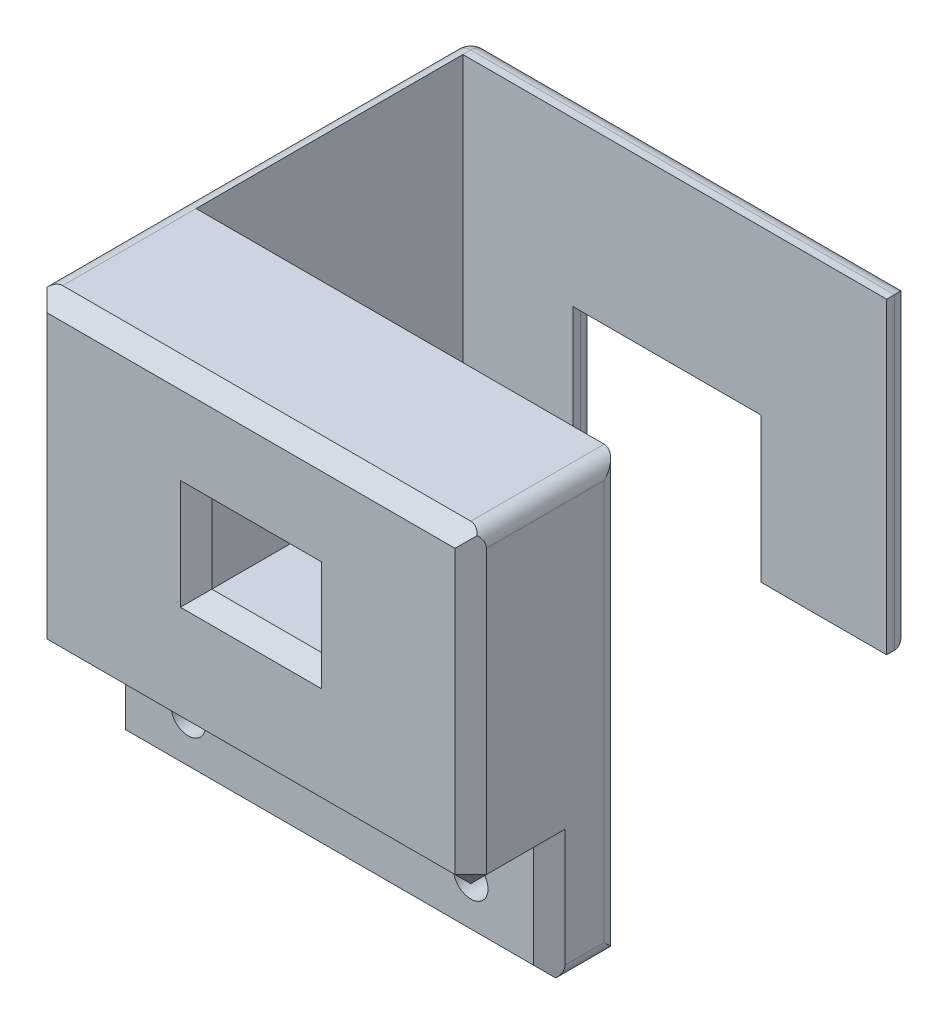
ISO-10303-21;
HEADER;
FILE_DESCRIPTION(('STEP AP214'),'2;1');
FILE_NAME('part.step','',(''),(''),'','','');
FILE_SCHEMA(('AUTOMOTIVE_DESIGN { 1 0 10303 214 1 1 1 1 }'));
ENDSEC;
DATA;
#1=APPLICATION_CONTEXT('core data for automotive mechanical design processes');
#2=APPLICATION_PROTOCOL_DEFINITION('international standard','automotive_design',2000,#1);
#3=PRODUCT_CONTEXT('',#1,'mechanical');
#4=PRODUCT('Part','Part','',(#3));
#5=PRODUCT_RELATED_PRODUCT_CATEGORY('part','',(#4));
#6=PRODUCT_DEFINITION_FORMATION('','',#4);
#7=PRODUCT_DEFINITION_CONTEXT('part definition',#1,'design');
#8=PRODUCT_DEFINITION('design','',#6,#7);
#9=PRODUCT_DEFINITION_SHAPE('','',#8);
#10=(LENGTH_UNIT() NAMED_UNIT(*) SI_UNIT(.MILLI.,.METRE.));
#11=(NAMED_UNIT(*) PLANE_ANGLE_UNIT() SI_UNIT($,.RADIAN.));
#12=(NAMED_UNIT(*) SI_UNIT($,.STERADIAN.) SOLID_ANGLE_UNIT());
#13=UNCERTAINTY_MEASURE_WITH_UNIT(LENGTH_MEASURE(1.E-05),#10,'distance_accuracy_value','');
#14=(GEOMETRIC_REPRESENTATION_CONTEXT(3) GLOBAL_UNCERTAINTY_ASSIGNED_CONTEXT((#13)) GLOBAL_UNIT_ASSIGNED_CONTEXT((#10,
#11,#12)) REPRESENTATION_CONTEXT('',''));
#15=CARTESIAN_POINT('',(0.,0.,0.));
#16=DIRECTION('',(0.,0.,1.));
#17=DIRECTION('',(1.,0.,0.));
#18=AXIS2_PLACEMENT_3D('',#15,#16,#17);
#19=CARTESIAN_POINT('',(0.,27.5,0.));
#20=DIRECTION('',(0.,-1.,0.));
#21=DIRECTION('',(0.,0.,-1.));
#22=AXIS2_PLACEMENT_3D('',#19,#20,#21);
#23=PLANE('',#22);
#24=DIRECTION('',(0.,0.,-1.));
#25=VECTOR('',#24,1.);
#26=CARTESIAN_POINT('',(14.,27.5,5.));
#27=LINE('',#26,#25);
#28=CARTESIAN_POINT('',(14.,27.5,-21.5));
#29=VERTEX_POINT('',#28);
#30=CARTESIAN_POINT('',(14.,27.5,-22.));
#31=VERTEX_POINT('',#30);
#32=EDGE_CURVE('E596',#29,#31,#27,.T.);
#33=ORIENTED_EDGE('',*,*,#32,.T.);
#34=DIRECTION('',(1.,0.,0.));
#35=VECTOR('',#34,1.);
#36=CARTESIAN_POINT('',(-14.,27.5,-22.));
#37=LINE('',#36,#35);
#38=CARTESIAN_POINT('',(-13.,27.5,-22.));
#39=VERTEX_POINT('',#38);
#40=EDGE_CURVE('E370',#31,#39,#37,.F.);
#41=ORIENTED_EDGE('',*,*,#40,.T.);
#42=DIRECTION('',(0.,0.,1.));
#43=VECTOR('',#42,1.);
#44=CARTESIAN_POINT('',(-13.,27.5,0.));
#45=LINE('',#44,#43);
#46=CARTESIAN_POINT('',(-13.,27.5,-21.5));
#47=VERTEX_POINT('',#46);
#48=EDGE_CURVE('E368',#39,#47,#45,.T.);
#49=ORIENTED_EDGE('',*,*,#48,.T.);
#50=DIRECTION('',(1.,0.,0.));
#51=VECTOR('',#50,1.);
#52=CARTESIAN_POINT('',(-13.,27.5,-21.5));
#53=LINE('',#52,#51);
#54=EDGE_CURVE('E303',#47,#29,#53,.T.);
#55=ORIENTED_EDGE('',*,*,#54,.T.);
#56=EDGE_LOOP('',(#33,#41,#49,#55));
#57=FACE_BOUND('',#56,.T.);
#58=ADVANCED_FACE('F39',(#57),#23,.F.);
#59=CARTESIAN_POINT('',(0.,0.,0.));
#60=DIRECTION('',(0.,-1.,0.));
#61=DIRECTION('',(0.,0.,-1.));
#62=AXIS2_PLACEMENT_3D('',#59,#60,#61);
#63=PLANE('',#62);
#64=DIRECTION('',(-1.,0.,0.));
#65=VECTOR('',#64,1.);
#66=CARTESIAN_POINT('',(-14.,0.,-1.));
#67=LINE('',#66,#65);
#68=CARTESIAN_POINT('',(13.,0.,-1.));
#69=VERTEX_POINT('',#68);
#70=CARTESIAN_POINT('',(-13.,0.,-1.));
#71=VERTEX_POINT('',#70);
#72=EDGE_CURVE('E490',#69,#71,#67,.T.);
#73=ORIENTED_EDGE('',*,*,#72,.T.);
#74=DIRECTION('',(0.,0.,1.));
#75=VECTOR('',#74,1.);
#76=CARTESIAN_POINT('',(-13.,0.,-20.));
#77=LINE('',#76,#75);
#78=CARTESIAN_POINT('',(-13.,0.,-4.5));
#79=VERTEX_POINT('',#78);
#80=EDGE_CURVE('E420',#71,#79,#77,.F.);
#81=ORIENTED_EDGE('',*,*,#80,.T.);
#82=DIRECTION('',(1.,0.,0.));
#83=VECTOR('',#82,1.);
#84=CARTESIAN_POINT('',(-13.,0.,-4.5));
#85=LINE('',#84,#83);
#86=CARTESIAN_POINT('',(13.,0.,-4.5));
#87=VERTEX_POINT('',#86);
#88=EDGE_CURVE('E491',#79,#87,#85,.T.);
#89=ORIENTED_EDGE('',*,*,#88,.T.);
#90=DIRECTION('',(0.,0.,-1.));
#91=VECTOR('',#90,1.);
#92=CARTESIAN_POINT('',(13.,0.,-1.));
#93=LINE('',#92,#91);
#94=EDGE_CURVE('E418',#87,#69,#93,.F.);
#95=ORIENTED_EDGE('',*,*,#94,.T.);
#96=EDGE_LOOP('',(#73,#81,#89,#95));
#97=FACE_BOUND('',#96,.T.);
#98=ADVANCED_FACE('F489',(#97),#63,.T.);
#99=CARTESIAN_POINT('',(14.,27.5,5.));
#100=DIRECTION('',(-1.,0.,0.));
#101=DIRECTION('',(0.,0.,1.));
#102=AXIS2_PLACEMENT_3D('',#99,#100,#101);
#103=PLANE('',#102);
#104=DIRECTION('',(0.,0.,-1.));
#105=VECTOR('',#104,1.);
#106=CARTESIAN_POINT('',(14.,7.87552601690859,-20.));
#107=LINE('',#106,#105);
#108=CARTESIAN_POINT('',(14.,7.87552601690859,-21.5));
#109=VERTEX_POINT('',#108);
#110=CARTESIAN_POINT('',(14.,7.87552601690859,-22.));
#111=VERTEX_POINT('',#110);
#112=EDGE_CURVE('E472',#109,#111,#107,.T.);
#113=ORIENTED_EDGE('',*,*,#112,.T.);
#114=DIRECTION('',(0.,-1.,0.));
#115=VECTOR('',#114,1.);
#116=CARTESIAN_POINT('',(14.,27.5,-22.));
#117=LINE('',#116,#115);
#118=EDGE_CURVE('E360',#111,#31,#117,.F.);
#119=ORIENTED_EDGE('',*,*,#118,.T.);
#120=ORIENTED_EDGE('',*,*,#32,.F.);
#121=DIRECTION('',(0.,1.,0.));
#122=VECTOR('',#121,1.);
#123=CARTESIAN_POINT('',(14.,27.5,-21.5));
#124=LINE('',#123,#122);
#125=EDGE_CURVE('E657',#109,#29,#124,.T.);
#126=ORIENTED_EDGE('',*,*,#125,.F.);
#127=EDGE_LOOP('',(#113,#119,#120,#126));
#128=FACE_BOUND('',#127,.T.);
#129=ADVANCED_FACE('F703',(#128),#103,.F.);
#130=CARTESIAN_POINT('',(-14.,27.5,5.));
#131=DIRECTION('',(0.,0.,-1.));
#132=DIRECTION('',(-1.,0.,0.));
#133=AXIS2_PLACEMENT_3D('',#130,#131,#132);
#134=PLANE('',#133);
#135=DIRECTION('',(-1.,0.,0.));
#136=VECTOR('',#135,1.);
#137=CARTESIAN_POINT('',(-14.,14.5,5.));
#138=LINE('',#137,#136);
#139=CARTESIAN_POINT('',(4.5,14.5,5.));
#140=VERTEX_POINT('',#139);
#141=CARTESIAN_POINT('',(-4.50000000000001,14.5,5.));
#142=VERTEX_POINT('',#141);
#143=EDGE_CURVE('E581',#140,#142,#138,.T.);
#144=ORIENTED_EDGE('',*,*,#143,.T.);
#145=DIRECTION('',(0.,1.,0.));
#146=VECTOR('',#145,1.);
#147=CARTESIAN_POINT('',(-4.50000000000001,27.5,5.));
#148=LINE('',#147,#146);
#149=CARTESIAN_POINT('',(-4.50000000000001,21.5,5.));
#150=VERTEX_POINT('',#149);
#151=EDGE_CURVE('E574',#142,#150,#148,.T.);
#152=ORIENTED_EDGE('',*,*,#151,.T.);
#153=DIRECTION('',(1.,0.,0.));
#154=VECTOR('',#153,1.);
#155=CARTESIAN_POINT('',(-14.,21.5,5.));
#156=LINE('',#155,#154);
#157=CARTESIAN_POINT('',(4.5,21.5,5.));
#158=VERTEX_POINT('',#157);
#159=EDGE_CURVE('E577',#150,#158,#156,.T.);
#160=ORIENTED_EDGE('',*,*,#159,.T.);
#161=DIRECTION('',(0.,-1.,0.));
#162=VECTOR('',#161,1.);
#163=CARTESIAN_POINT('',(4.5,27.5,5.));
#164=LINE('',#163,#162);
#165=EDGE_CURVE('E579',#158,#140,#164,.T.);
#166=ORIENTED_EDGE('',*,*,#165,.T.);
#167=EDGE_LOOP('',(#144,#152,#160,#166));
#168=FACE_BOUND('',#167,.T.);
#169=DIRECTION('',(0.,-1.,0.));
#170=VECTOR('',#169,1.);
#171=CARTESIAN_POINT('',(-13.,27.5,5.));
#172=LINE('',#171,#170);
#173=CARTESIAN_POINT('',(-13.,26.5,5.));
#174=VERTEX_POINT('',#173);
#175=CARTESIAN_POINT('',(-13.,8.5,5.));
#176=VERTEX_POINT('',#175);
#177=EDGE_CURVE('E586',#174,#176,#172,.T.);
#178=ORIENTED_EDGE('',*,*,#177,.T.);
#179=DIRECTION('',(1.,0.,0.));
#180=VECTOR('',#179,1.);
#181=CARTESIAN_POINT('',(14.,8.5,5.));
#182=LINE('',#181,#180);
#183=CARTESIAN_POINT('',(13.,8.5,5.));
#184=VERTEX_POINT('',#183);
#185=EDGE_CURVE('E583',#176,#184,#182,.T.);
#186=ORIENTED_EDGE('',*,*,#185,.T.);
#187=DIRECTION('',(0.,1.,0.));
#188=VECTOR('',#187,1.);
#189=CARTESIAN_POINT('',(13.,27.5,5.));
#190=LINE('',#189,#188);
#191=CARTESIAN_POINT('',(13.,26.5,5.));
#192=VERTEX_POINT('',#191);
#193=EDGE_CURVE('E588',#184,#192,#190,.T.);
#194=ORIENTED_EDGE('',*,*,#193,.T.);
#195=DIRECTION('',(-1.,0.,0.));
#196=VECTOR('',#195,1.);
#197=CARTESIAN_POINT('',(-14.,26.5,5.));
#198=LINE('',#197,#196);
#199=EDGE_CURVE('E591',#192,#174,#198,.T.);
#200=ORIENTED_EDGE('',*,*,#199,.T.);
#201=EDGE_LOOP('',(#178,#186,#194,#200));
#202=FACE_BOUND('',#201,.T.);
#203=ADVANCED_FACE('F775',(#168,#202),#134,.F.);
#204=DIRECTION('',(0.,-1.,0.));
#205=VECTOR('',#204,1.);
#206=CARTESIAN_POINT('',(14.,27.5,-3.5));
#207=LINE('',#206,#205);
#208=CARTESIAN_POINT('',(14.,1.,-3.5));
#209=VERTEX_POINT('',#208);
#210=CARTESIAN_POINT('',(14.,26.5,-3.5));
#211=VERTEX_POINT('',#210);
#212=EDGE_CURVE('E56',#209,#211,#207,.F.);
#213=ORIENTED_EDGE('',*,*,#212,.T.);
#214=DIRECTION('',(0.,0.,-1.));
#215=VECTOR('',#214,1.);
#216=CARTESIAN_POINT('',(14.,26.5,5.));
#217=LINE('',#216,#215);
#218=CARTESIAN_POINT('',(14.,26.5,4.));
#219=VERTEX_POINT('',#218);
#220=EDGE_CURVE('E424',#211,#219,#217,.F.);
#221=ORIENTED_EDGE('',*,*,#220,.T.);
#222=DIRECTION('',(0.,-1.,0.));
#223=VECTOR('',#222,1.);
#224=CARTESIAN_POINT('',(14.,27.5,4.));
#225=LINE('',#224,#223);
#226=CARTESIAN_POINT('',(14.,8.5,4.));
#227=VERTEX_POINT('',#226);
#228=EDGE_CURVE('E498',#219,#227,#225,.T.);
#229=ORIENTED_EDGE('',*,*,#228,.T.);
#230=DIRECTION('',(0.,0.,-1.));
#231=VECTOR('',#230,1.);
#232=CARTESIAN_POINT('',(14.,8.5,0.));
#233=LINE('',#232,#231);
#234=CARTESIAN_POINT('',(14.,8.5,-1.));
#235=VERTEX_POINT('',#234);
#236=EDGE_CURVE('E501',#227,#235,#233,.T.);
#237=ORIENTED_EDGE('',*,*,#236,.T.);
#238=DIRECTION('',(0.,-1.,0.));
#239=VECTOR('',#238,1.);
#240=CARTESIAN_POINT('',(14.,27.5,-1.));
#241=LINE('',#240,#239);
#242=CARTESIAN_POINT('',(14.,1.,-1.));
#243=VERTEX_POINT('',#242);
#244=EDGE_CURVE('E326',#235,#243,#241,.T.);
#245=ORIENTED_EDGE('',*,*,#244,.T.);
#246=DIRECTION('',(0.,0.,-1.));
#247=VECTOR('',#246,1.);
#248=CARTESIAN_POINT('',(14.,1.,-4.5));
#249=LINE('',#248,#247);
#250=EDGE_CURVE('E61',#243,#209,#249,.T.);
#251=ORIENTED_EDGE('',*,*,#250,.T.);
#252=EDGE_LOOP('',(#213,#221,#229,#237,#245,#251));
#253=FACE_BOUND('',#252,.T.);
#254=ADVANCED_FACE('F769',(#253),#103,.F.);
#255=CARTESIAN_POINT('',(-14.,27.5,5.));
#256=DIRECTION('',(1.,0.,0.));
#257=DIRECTION('',(0.,0.,-1.));
#258=AXIS2_PLACEMENT_3D('',#255,#256,#257);
#259=PLANE('',#258);
#260=DIRECTION('',(0.,-1.,0.));
#261=VECTOR('',#260,1.);
#262=CARTESIAN_POINT('',(-14.,27.5,3.5857864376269));
#263=LINE('',#262,#261);
#264=CARTESIAN_POINT('',(-14.,8.9142135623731,3.5857864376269));
#265=VERTEX_POINT('',#264);
#266=CARTESIAN_POINT('',(-14.,26.5,3.5857864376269));
#267=VERTEX_POINT('',#266);
#268=EDGE_CURVE('E399',#265,#267,#263,.F.);
#269=ORIENTED_EDGE('',*,*,#268,.T.);
#270=DIRECTION('',(0.,0.,1.));
#271=VECTOR('',#270,1.);
#272=CARTESIAN_POINT('',(-14.,26.5,5.));
#273=LINE('',#272,#271);
#274=CARTESIAN_POINT('',(-14.,26.5,-22.));
#275=VERTEX_POINT('',#274);
#276=EDGE_CURVE('E401',#267,#275,#273,.F.);
#277=ORIENTED_EDGE('',*,*,#276,.T.);
#278=DIRECTION('',(0.,1.,0.));
#279=VECTOR('',#278,1.);
#280=CARTESIAN_POINT('',(-14.,7.87552601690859,-22.));
#281=LINE('',#280,#279);
#282=CARTESIAN_POINT('',(-14.,8.87552601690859,-22.));
#283=VERTEX_POINT('',#282);
#284=EDGE_CURVE('E388',#275,#283,#281,.F.);
#285=ORIENTED_EDGE('',*,*,#284,.T.);
#286=DIRECTION('',(0.,0.,-1.));
#287=VECTOR('',#286,1.);
#288=CARTESIAN_POINT('',(-14.,8.87552601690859,5.));
#289=LINE('',#288,#287);
#290=CARTESIAN_POINT('',(-14.,8.87552601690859,-19.));
#291=VERTEX_POINT('',#290);
#292=EDGE_CURVE('E390',#283,#291,#289,.F.);
#293=ORIENTED_EDGE('',*,*,#292,.T.);
#294=DIRECTION('',(0.,1.,0.));
#295=VECTOR('',#294,1.);
#296=CARTESIAN_POINT('',(-14.,0.,-19.));
#297=LINE('',#296,#295);
#298=CARTESIAN_POINT('',(-14.,1.,-19.));
#299=VERTEX_POINT('',#298);
#300=EDGE_CURVE('E392',#291,#299,#297,.F.);
#301=ORIENTED_EDGE('',*,*,#300,.T.);
#302=DIRECTION('',(0.,0.,1.));
#303=VECTOR('',#302,1.);
#304=CARTESIAN_POINT('',(-14.,1.,-1.));
#305=LINE('',#304,#303);
#306=CARTESIAN_POINT('',(-14.,1.,-1.4142135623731));
#307=VERTEX_POINT('',#306);
#308=EDGE_CURVE('E310',#299,#307,#305,.T.);
#309=ORIENTED_EDGE('',*,*,#308,.T.);
#310=DIRECTION('',(0.,-1.,0.));
#311=VECTOR('',#310,1.);
#312=CARTESIAN_POINT('',(-14.,8.5,-1.4142135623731));
#313=LINE('',#312,#311);
#314=CARTESIAN_POINT('',(-14.,8.9142135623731,-1.4142135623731));
#315=VERTEX_POINT('',#314);
#316=EDGE_CURVE('E395',#307,#315,#313,.F.);
#317=ORIENTED_EDGE('',*,*,#316,.T.);
#318=DIRECTION('',(0.,0.,1.));
#319=VECTOR('',#318,1.);
#320=CARTESIAN_POINT('',(-14.,8.9142135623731,4.));
#321=LINE('',#320,#319);
#322=EDGE_CURVE('E397',#315,#265,#321,.T.);
#323=ORIENTED_EDGE('',*,*,#322,.T.);
#324=EDGE_LOOP('',(#269,#277,#285,#293,#301,#309,#317,#323));
#325=FACE_BOUND('',#324,.T.);
#326=ADVANCED_FACE('F763',(#325),#259,.F.);
#327=DIRECTION('',(1.,0.,0.));
#328=VECTOR('',#327,1.);
#329=CARTESIAN_POINT('',(-13.,27.5,-4.5));
#330=LINE('',#329,#328);
#331=CARTESIAN_POINT('',(-13.,27.5,-4.5));
#332=VERTEX_POINT('',#331);
#333=CARTESIAN_POINT('',(13.,27.5,-4.5));
#334=VERTEX_POINT('',#333);
#335=EDGE_CURVE('E653',#332,#334,#330,.T.);
#336=ORIENTED_EDGE('',*,*,#335,.F.);
#337=DIRECTION('',(0.,0.,1.));
#338=VECTOR('',#337,1.);
#339=CARTESIAN_POINT('',(-13.,27.5,0.));
#340=LINE('',#339,#338);
#341=CARTESIAN_POINT('',(-13.,27.5,4.));
#342=VERTEX_POINT('',#341);
#343=EDGE_CURVE('E366',#332,#342,#340,.T.);
#344=ORIENTED_EDGE('',*,*,#343,.T.);
#345=DIRECTION('',(1.,0.,0.));
#346=VECTOR('',#345,1.);
#347=CARTESIAN_POINT('',(0.,27.5,4.));
#348=LINE('',#347,#346);
#349=CARTESIAN_POINT('',(13.,27.5,4.));
#350=VERTEX_POINT('',#349);
#351=EDGE_CURVE('E321',#342,#350,#348,.T.);
#352=ORIENTED_EDGE('',*,*,#351,.T.);
#353=DIRECTION('',(0.,0.,-1.));
#354=VECTOR('',#353,1.);
#355=CARTESIAN_POINT('',(13.,27.5,0.));
#356=LINE('',#355,#354);
#357=EDGE_CURVE('E363',#350,#334,#356,.T.);
#358=ORIENTED_EDGE('',*,*,#357,.T.);
#359=EDGE_LOOP('',(#336,#344,#352,#358));
#360=FACE_BOUND('',#359,.T.);
#361=ADVANCED_FACE('F720',(#360),#23,.F.);
#362=CARTESIAN_POINT('',(-14.,7.5,0.));
#363=DIRECTION('',(0.,0.,-1.));
#364=DIRECTION('',(-1.,0.,0.));
#365=AXIS2_PLACEMENT_3D('',#362,#363,#364);
#366=PLANE('',#365);
#367=CARTESIAN_POINT('',(9.,3.75,0.));
#368=DIRECTION('',(0.,0.,-1.));
#369=DIRECTION('',(-1.,0.,0.));
#370=AXIS2_PLACEMENT_3D('',#367,#368,#369);
#371=CIRCLE('',#370,1.1);
#372=CARTESIAN_POINT('',(7.9,3.75,0.));
#373=VERTEX_POINT('',#372);
#374=EDGE_CURVE('E597',#373,#373,#371,.T.);
#375=ORIENTED_EDGE('',*,*,#374,.T.);
#376=EDGE_LOOP('',(#375));
#377=FACE_BOUND('',#376,.T.);
#378=CARTESIAN_POINT('',(-9.,3.75,0.));
#379=DIRECTION('',(0.,0.,-1.));
#380=DIRECTION('',(-1.,0.,0.));
#381=AXIS2_PLACEMENT_3D('',#378,#379,#380);
#382=CIRCLE('',#381,1.1);
#383=CARTESIAN_POINT('',(-10.1,3.75,0.));
#384=VERTEX_POINT('',#383);
#385=EDGE_CURVE('E601',#384,#384,#382,.T.);
#386=ORIENTED_EDGE('',*,*,#385,.T.);
#387=EDGE_LOOP('',(#386));
#388=FACE_BOUND('',#387,.T.);
#389=DIRECTION('',(1.,0.,0.));
#390=VECTOR('',#389,1.);
#391=CARTESIAN_POINT('',(-14.,7.5,0.));
#392=LINE('',#391,#390);
#393=CARTESIAN_POINT('',(-13.,7.5,0.));
#394=VERTEX_POINT('',#393);
#395=CARTESIAN_POINT('',(13.,7.5,0.));
#396=VERTEX_POINT('',#395);
#397=EDGE_CURVE('E607',#394,#396,#392,.T.);
#398=ORIENTED_EDGE('',*,*,#397,.F.);
#399=DIRECTION('',(0.,-1.,0.));
#400=VECTOR('',#399,1.);
#401=CARTESIAN_POINT('',(-13.,7.5,0.));
#402=LINE('',#401,#400);
#403=CARTESIAN_POINT('',(-13.,1.,0.));
#404=VERTEX_POINT('',#403);
#405=EDGE_CURVE('E499',#394,#404,#402,.T.);
#406=ORIENTED_EDGE('',*,*,#405,.T.);
#407=DIRECTION('',(1.,0.,0.));
#408=VECTOR('',#407,1.);
#409=CARTESIAN_POINT('',(14.,1.,0.));
#410=LINE('',#409,#408);
#411=CARTESIAN_POINT('',(13.,1.,0.));
#412=VERTEX_POINT('',#411);
#413=EDGE_CURVE('E504',#404,#412,#410,.T.);
#414=ORIENTED_EDGE('',*,*,#413,.T.);
#415=DIRECTION('',(0.,1.,0.));
#416=VECTOR('',#415,1.);
#417=CARTESIAN_POINT('',(13.,7.5,0.));
#418=LINE('',#417,#416);
#419=EDGE_CURVE('E555',#412,#396,#418,.T.);
#420=ORIENTED_EDGE('',*,*,#419,.T.);
#421=EDGE_LOOP('',(#398,#406,#414,#420));
#422=FACE_BOUND('',#421,.T.);
#423=ADVANCED_FACE('F762',(#377,#388,#422),#366,.F.);
#424=CARTESIAN_POINT('',(0.,7.5,0.));
#425=DIRECTION('',(0.,-1.,0.));
#426=DIRECTION('',(0.,0.,-1.));
#427=AXIS2_PLACEMENT_3D('',#424,#425,#426);
#428=PLANE('',#427);
#429=DIRECTION('',(-1.,0.,0.));
#430=VECTOR('',#429,1.);
#431=CARTESIAN_POINT('',(-14.,7.5,4.));
#432=LINE('',#431,#430);
#433=CARTESIAN_POINT('',(13.,7.5,4.));
#434=VERTEX_POINT('',#433);
#435=CARTESIAN_POINT('',(-13.,7.5,4.));
#436=VERTEX_POINT('',#435);
#437=EDGE_CURVE('E563',#434,#436,#432,.T.);
#438=ORIENTED_EDGE('',*,*,#437,.T.);
#439=DIRECTION('',(0.,0.,-1.));
#440=VECTOR('',#439,1.);
#441=CARTESIAN_POINT('',(-13.,7.5,0.));
#442=LINE('',#441,#440);
#443=EDGE_CURVE('E558',#436,#394,#442,.T.);
#444=ORIENTED_EDGE('',*,*,#443,.T.);
#445=ORIENTED_EDGE('',*,*,#397,.T.);
#446=DIRECTION('',(0.,0.,1.));
#447=VECTOR('',#446,1.);
#448=CARTESIAN_POINT('',(13.,7.5,5.));
#449=LINE('',#448,#447);
#450=EDGE_CURVE('E566',#396,#434,#449,.T.);
#451=ORIENTED_EDGE('',*,*,#450,.T.);
#452=EDGE_LOOP('',(#438,#444,#445,#451));
#453=FACE_BOUND('',#452,.T.);
#454=ADVANCED_FACE('F738',(#453),#428,.T.);
#455=CARTESIAN_POINT('',(-9.,3.75,-3.));
#456=DIRECTION('',(0.,0.,-1.));
#457=DIRECTION('',(-1.,0.,0.));
#458=AXIS2_PLACEMENT_3D('',#455,#456,#457);
#459=CYLINDRICAL_SURFACE('',#458,2.);
#460=CARTESIAN_POINT('',(-9.,3.75,-4.5));
#461=DIRECTION('',(0.,0.,1.));
#462=DIRECTION('',(0.,-1.,0.));
#463=AXIS2_PLACEMENT_3D('',#460,#461,#462);
#464=CIRCLE('',#463,2.);
#465=CARTESIAN_POINT('',(-9.,1.75,-4.5));
#466=VERTEX_POINT('',#465);
#467=EDGE_CURVE('E645',#466,#466,#464,.F.);
#468=ORIENTED_EDGE('',*,*,#467,.T.);
#469=EDGE_LOOP('',(#468));
#470=FACE_BOUND('',#469,.T.);
#471=CARTESIAN_POINT('',(-9.,3.75,-3.));
#472=DIRECTION('',(0.,0.,-1.));
#473=DIRECTION('',(-1.,0.,0.));
#474=AXIS2_PLACEMENT_3D('',#471,#472,#473);
#475=CIRCLE('',#474,2.);
#476=CARTESIAN_POINT('',(-11.,3.75,-3.));
#477=VERTEX_POINT('',#476);
#478=EDGE_CURVE('E600',#477,#477,#475,.T.);
#479=ORIENTED_EDGE('',*,*,#478,.F.);
#480=EDGE_LOOP('',(#479));
#481=FACE_BOUND('',#480,.T.);
#482=ADVANCED_FACE('F734',(#470,#481),#459,.F.);
#483=CARTESIAN_POINT('',(-9.,3.75,-3.));
#484=DIRECTION('',(0.,0.,-1.));
#485=DIRECTION('',(-1.,0.,0.));
#486=AXIS2_PLACEMENT_3D('',#483,#484,#485);
#487=PLANE('',#486);
#488=CARTESIAN_POINT('',(-9.,3.75,-3.));
#489=DIRECTION('',(0.,0.,-1.));
#490=DIRECTION('',(-1.,0.,0.));
#491=AXIS2_PLACEMENT_3D('',#488,#489,#490);
#492=CIRCLE('',#491,1.1);
#493=CARTESIAN_POINT('',(-10.1,3.75,-3.));
#494=VERTEX_POINT('',#493);
#495=EDGE_CURVE('E615',#494,#494,#492,.T.);
#496=ORIENTED_EDGE('',*,*,#495,.F.);
#497=EDGE_LOOP('',(#496));
#498=FACE_BOUND('',#497,.T.);
#499=ORIENTED_EDGE('',*,*,#478,.T.);
#500=EDGE_LOOP('',(#499));
#501=FACE_BOUND('',#500,.T.);
#502=ADVANCED_FACE('F737',(#498,#501),#487,.T.);
#503=CARTESIAN_POINT('',(9.,3.75,-3.));
#504=DIRECTION('',(0.,0.,-1.));
#505=DIRECTION('',(-1.,0.,0.));
#506=AXIS2_PLACEMENT_3D('',#503,#504,#505);
#507=CYLINDRICAL_SURFACE('',#506,2.);
#508=CARTESIAN_POINT('',(9.,3.75,-4.5));
#509=DIRECTION('',(0.,0.,1.));
#510=DIRECTION('',(0.,-1.,0.));
#511=AXIS2_PLACEMENT_3D('',#508,#509,#510);
#512=CIRCLE('',#511,2.);
#513=CARTESIAN_POINT('',(9.,1.75,-4.5));
#514=VERTEX_POINT('',#513);
#515=EDGE_CURVE('E648',#514,#514,#512,.F.);
#516=ORIENTED_EDGE('',*,*,#515,.T.);
#517=EDGE_LOOP('',(#516));
#518=FACE_BOUND('',#517,.T.);
#519=CARTESIAN_POINT('',(9.,3.75,-3.));
#520=DIRECTION('',(0.,0.,-1.));
#521=DIRECTION('',(-1.,0.,0.));
#522=AXIS2_PLACEMENT_3D('',#519,#520,#521);
#523=CIRCLE('',#522,2.);
#524=CARTESIAN_POINT('',(7.,3.75,-3.));
#525=VERTEX_POINT('',#524);
#526=EDGE_CURVE('E610',#525,#525,#523,.T.);
#527=ORIENTED_EDGE('',*,*,#526,.F.);
#528=EDGE_LOOP('',(#527));
#529=FACE_BOUND('',#528,.T.);
#530=ADVANCED_FACE('F743',(#518,#529),#507,.F.);
#531=CARTESIAN_POINT('',(9.,3.75,-3.));
#532=DIRECTION('',(0.,0.,-1.));
#533=DIRECTION('',(-1.,0.,0.));
#534=AXIS2_PLACEMENT_3D('',#531,#532,#533);
#535=PLANE('',#534);
#536=CARTESIAN_POINT('',(9.,3.75,-3.));
#537=DIRECTION('',(0.,0.,-1.));
#538=DIRECTION('',(-1.,0.,0.));
#539=AXIS2_PLACEMENT_3D('',#536,#537,#538);
#540=CIRCLE('',#539,1.1);
#541=CARTESIAN_POINT('',(7.9,3.75,-3.));
#542=VERTEX_POINT('',#541);
#543=EDGE_CURVE('E604',#542,#542,#540,.T.);
#544=ORIENTED_EDGE('',*,*,#543,.F.);
#545=EDGE_LOOP('',(#544));
#546=FACE_BOUND('',#545,.T.);
#547=ORIENTED_EDGE('',*,*,#526,.T.);
#548=EDGE_LOOP('',(#547));
#549=FACE_BOUND('',#548,.T.);
#550=ADVANCED_FACE('F749',(#546,#549),#535,.T.);
#551=CARTESIAN_POINT('',(-9.,3.75,2.));
#552=DIRECTION('',(0.,0.,-1.));
#553=DIRECTION('',(-1.,0.,0.));
#554=AXIS2_PLACEMENT_3D('',#551,#552,#553);
#555=CYLINDRICAL_SURFACE('',#554,1.1);
#556=ORIENTED_EDGE('',*,*,#495,.T.);
#557=EDGE_LOOP('',(#556));
#558=FACE_BOUND('',#557,.T.);
#559=ORIENTED_EDGE('',*,*,#385,.F.);
#560=EDGE_LOOP('',(#559));
#561=FACE_BOUND('',#560,.T.);
#562=ADVANCED_FACE('F1199',(#558,#561),#555,.F.);
#563=CARTESIAN_POINT('',(9.,3.75,2.));
#564=DIRECTION('',(0.,0.,-1.));
#565=DIRECTION('',(-1.,0.,0.));
#566=AXIS2_PLACEMENT_3D('',#563,#564,#565);
#567=CYLINDRICAL_SURFACE('',#566,1.1);
#568=ORIENTED_EDGE('',*,*,#543,.T.);
#569=EDGE_LOOP('',(#568));
#570=FACE_BOUND('',#569,.T.);
#571=ORIENTED_EDGE('',*,*,#374,.F.);
#572=EDGE_LOOP('',(#571));
#573=FACE_BOUND('',#572,.T.);
#574=ADVANCED_FACE('F1191',(#570,#573),#567,.F.);
#575=CARTESIAN_POINT('',(3.5,15.5,-0.999999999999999));
#576=DIRECTION('',(1.,0.,0.));
#577=DIRECTION('',(0.,0.,-1.));
#578=AXIS2_PLACEMENT_3D('',#575,#576,#577);
#579=PLANE('',#578);
#580=DIRECTION('',(0.,0.,1.));
#581=VECTOR('',#580,1.);
#582=CARTESIAN_POINT('',(3.5,15.5,-0.999999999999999));
#583=LINE('',#582,#581);
#584=CARTESIAN_POINT('',(3.5,15.5,-0.999999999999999));
#585=VERTEX_POINT('',#584);
#586=CARTESIAN_POINT('',(3.5,15.5,4.));
#587=VERTEX_POINT('',#586);
#588=EDGE_CURVE('E618',#585,#587,#583,.T.);
#589=ORIENTED_EDGE('',*,*,#588,.T.);
#590=DIRECTION('',(0.,1.,0.));
#591=VECTOR('',#590,1.);
#592=CARTESIAN_POINT('',(3.5,15.5,4.));
#593=LINE('',#592,#591);
#594=CARTESIAN_POINT('',(3.5,20.5,4.));
#595=VERTEX_POINT('',#594);
#596=EDGE_CURVE('E570',#587,#595,#593,.T.);
#597=ORIENTED_EDGE('',*,*,#596,.T.);
#598=DIRECTION('',(0.,0.,1.));
#599=VECTOR('',#598,1.);
#600=CARTESIAN_POINT('',(3.5,20.5,-0.999999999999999));
#601=LINE('',#600,#599);
#602=CARTESIAN_POINT('',(3.5,20.5,-0.999999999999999));
#603=VERTEX_POINT('',#602);
#604=EDGE_CURVE('E621',#603,#595,#601,.T.);
#605=ORIENTED_EDGE('',*,*,#604,.F.);
#606=DIRECTION('',(0.,1.,0.));
#607=VECTOR('',#606,1.);
#608=CARTESIAN_POINT('',(3.5,15.5,-0.999999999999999));
#609=LINE('',#608,#607);
#610=EDGE_CURVE('E521',#585,#603,#609,.T.);
#611=ORIENTED_EDGE('',*,*,#610,.F.);
#612=EDGE_LOOP('',(#589,#597,#605,#611));
#613=FACE_BOUND('',#612,.T.);
#614=ADVANCED_FACE('F1183',(#613),#579,.F.);
#615=CARTESIAN_POINT('',(-3.5,15.5,-0.999999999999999));
#616=DIRECTION('',(0.,-1.,0.));
#617=DIRECTION('',(0.,0.,-1.));
#618=AXIS2_PLACEMENT_3D('',#615,#616,#617);
#619=PLANE('',#618);
#620=DIRECTION('',(0.,0.,1.));
#621=VECTOR('',#620,1.);
#622=CARTESIAN_POINT('',(-3.5,15.5,-0.999999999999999));
#623=LINE('',#622,#621);
#624=CARTESIAN_POINT('',(-3.5,15.5,-0.999999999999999));
#625=VERTEX_POINT('',#624);
#626=CARTESIAN_POINT('',(-3.5,15.5,4.));
#627=VERTEX_POINT('',#626);
#628=EDGE_CURVE('E628',#625,#627,#623,.T.);
#629=ORIENTED_EDGE('',*,*,#628,.T.);
#630=DIRECTION('',(1.,0.,0.));
#631=VECTOR('',#630,1.);
#632=CARTESIAN_POINT('',(-3.5,15.5,4.));
#633=LINE('',#632,#631);
#634=EDGE_CURVE('E568',#627,#587,#633,.T.);
#635=ORIENTED_EDGE('',*,*,#634,.T.);
#636=ORIENTED_EDGE('',*,*,#588,.F.);
#637=DIRECTION('',(1.,0.,0.));
#638=VECTOR('',#637,1.);
#639=CARTESIAN_POINT('',(-3.5,15.5,-0.999999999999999));
#640=LINE('',#639,#638);
#641=EDGE_CURVE('E625',#625,#585,#640,.T.);
#642=ORIENTED_EDGE('',*,*,#641,.F.);
#643=EDGE_LOOP('',(#629,#635,#636,#642));
#644=FACE_BOUND('',#643,.T.);
#645=ADVANCED_FACE('F1175',(#644),#619,.F.);
#646=CARTESIAN_POINT('',(-3.5,15.5,-0.999999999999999));
#647=DIRECTION('',(-1.,0.,0.));
#648=DIRECTION('',(0.,0.,1.));
#649=AXIS2_PLACEMENT_3D('',#646,#647,#648);
#650=PLANE('',#649);
#651=DIRECTION('',(0.,0.,1.));
#652=VECTOR('',#651,1.);
#653=CARTESIAN_POINT('',(-3.5,20.5,-0.999999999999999));
#654=LINE('',#653,#652);
#655=CARTESIAN_POINT('',(-3.5,20.5,-0.999999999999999));
#656=VERTEX_POINT('',#655);
#657=CARTESIAN_POINT('',(-3.5,20.5,4.));
#658=VERTEX_POINT('',#657);
#659=EDGE_CURVE('E624',#656,#658,#654,.T.);
#660=ORIENTED_EDGE('',*,*,#659,.T.);
#661=DIRECTION('',(0.,-1.,0.));
#662=VECTOR('',#661,1.);
#663=CARTESIAN_POINT('',(-3.5,15.5,4.));
#664=LINE('',#663,#662);
#665=EDGE_CURVE('E593',#658,#627,#664,.T.);
#666=ORIENTED_EDGE('',*,*,#665,.T.);
#667=ORIENTED_EDGE('',*,*,#628,.F.);
#668=DIRECTION('',(0.,-1.,0.));
#669=VECTOR('',#668,1.);
#670=CARTESIAN_POINT('',(-3.5,15.5,-0.999999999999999));
#671=LINE('',#670,#669);
#672=EDGE_CURVE('E635',#656,#625,#671,.T.);
#673=ORIENTED_EDGE('',*,*,#672,.F.);
#674=EDGE_LOOP('',(#660,#666,#667,#673));
#675=FACE_BOUND('',#674,.T.);
#676=ADVANCED_FACE('F1167',(#675),#650,.F.);
#677=CARTESIAN_POINT('',(-3.5,20.5,-0.999999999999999));
#678=DIRECTION('',(0.,1.,0.));
#679=DIRECTION('',(0.,0.,1.));
#680=AXIS2_PLACEMENT_3D('',#677,#678,#679);
#681=PLANE('',#680);
#682=ORIENTED_EDGE('',*,*,#604,.T.);
#683=DIRECTION('',(-1.,0.,0.));
#684=VECTOR('',#683,1.);
#685=CARTESIAN_POINT('',(-3.5,20.5,4.));
#686=LINE('',#685,#684);
#687=EDGE_CURVE('E572',#595,#658,#686,.T.);
#688=ORIENTED_EDGE('',*,*,#687,.T.);
#689=ORIENTED_EDGE('',*,*,#659,.F.);
#690=DIRECTION('',(-1.,0.,0.));
#691=VECTOR('',#690,1.);
#692=CARTESIAN_POINT('',(-3.5,20.5,-0.999999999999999));
#693=LINE('',#692,#691);
#694=EDGE_CURVE('E638',#603,#656,#693,.T.);
#695=ORIENTED_EDGE('',*,*,#694,.F.);
#696=EDGE_LOOP('',(#682,#688,#689,#695));
#697=FACE_BOUND('',#696,.T.);
#698=ADVANCED_FACE('F1158',(#697),#681,.F.);
#699=CARTESIAN_POINT('',(0.,0.,-0.999999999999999));
#700=DIRECTION('',(0.,0.,-1.));
#701=DIRECTION('',(-1.,0.,0.));
#702=AXIS2_PLACEMENT_3D('',#699,#700,#701);
#703=PLANE('',#702);
#704=ORIENTED_EDGE('',*,*,#610,.T.);
#705=ORIENTED_EDGE('',*,*,#694,.T.);
#706=ORIENTED_EDGE('',*,*,#672,.T.);
#707=ORIENTED_EDGE('',*,*,#641,.T.);
#708=EDGE_LOOP('',(#704,#705,#706,#707));
#709=FACE_BOUND('',#708,.T.);
#710=ADVANCED_FACE('F807',(#709),#703,.F.);
#711=CARTESIAN_POINT('',(3.5,15.5,4.));
#712=DIRECTION('',(0.707106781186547,0.,-0.707106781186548));
#713=DIRECTION('',(0.,1.,0.));
#714=AXIS2_PLACEMENT_3D('',#711,#712,#713);
#715=PLANE('',#714);
#716=DIRECTION('',(-0.577350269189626,0.577350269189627,-0.577350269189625));
#717=VECTOR('',#716,1.);
#718=CARTESIAN_POINT('',(3.5,15.5,4.));
#719=LINE('',#718,#717);
#720=EDGE_CURVE('E515',#140,#587,#719,.T.);
#721=ORIENTED_EDGE('',*,*,#720,.F.);
#722=ORIENTED_EDGE('',*,*,#165,.F.);
#723=DIRECTION('',(-0.577350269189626,-0.577350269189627,-0.577350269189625));
#724=VECTOR('',#723,1.);
#725=CARTESIAN_POINT('',(1.16666666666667,18.1666666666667,1.66666666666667));
#726=LINE('',#725,#724);
#727=EDGE_CURVE('E518',#595,#158,#726,.F.);
#728=ORIENTED_EDGE('',*,*,#727,.F.);
#729=ORIENTED_EDGE('',*,*,#596,.F.);
#730=EDGE_LOOP('',(#721,#722,#728,#729));
#731=FACE_BOUND('',#730,.T.);
#732=ADVANCED_FACE('F801',(#731),#715,.F.);
#733=CARTESIAN_POINT('',(-3.5,20.5,4.));
#734=DIRECTION('',(0.,0.707106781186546,-0.707106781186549));
#735=DIRECTION('',(-1.,0.,0.));
#736=AXIS2_PLACEMENT_3D('',#733,#734,#735);
#737=PLANE('',#736);
#738=ORIENTED_EDGE('',*,*,#727,.T.);
#739=ORIENTED_EDGE('',*,*,#159,.F.);
#740=DIRECTION('',(0.577350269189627,-0.577350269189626,-0.577350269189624));
#741=VECTOR('',#740,1.);
#742=CARTESIAN_POINT('',(-1.83333333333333,18.8333333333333,2.33333333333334));
#743=LINE('',#742,#741);
#744=EDGE_CURVE('E512',#658,#150,#743,.F.);
#745=ORIENTED_EDGE('',*,*,#744,.F.);
#746=ORIENTED_EDGE('',*,*,#687,.F.);
#747=EDGE_LOOP('',(#738,#739,#745,#746));
#748=FACE_BOUND('',#747,.T.);
#749=ADVANCED_FACE('F794',(#748),#737,.F.);
#750=CARTESIAN_POINT('',(-3.5,15.5,4.));
#751=DIRECTION('',(0.,-0.707106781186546,-0.707106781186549));
#752=DIRECTION('',(1.,0.,0.));
#753=AXIS2_PLACEMENT_3D('',#750,#751,#752);
#754=PLANE('',#753);
#755=ORIENTED_EDGE('',*,*,#720,.T.);
#756=ORIENTED_EDGE('',*,*,#634,.F.);
#757=DIRECTION('',(-0.577350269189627,-0.577350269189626,0.577350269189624));
#758=VECTOR('',#757,1.);
#759=CARTESIAN_POINT('',(-3.5,15.5,4.));
#760=LINE('',#759,#758);
#761=EDGE_CURVE('E510',#142,#627,#760,.F.);
#762=ORIENTED_EDGE('',*,*,#761,.F.);
#763=ORIENTED_EDGE('',*,*,#143,.F.);
#764=EDGE_LOOP('',(#755,#756,#762,#763));
#765=FACE_BOUND('',#764,.T.);
#766=ADVANCED_FACE('F787',(#765),#754,.F.);
#767=CARTESIAN_POINT('',(-3.5,15.5,4.));
#768=DIRECTION('',(-0.707106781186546,0.,-0.707106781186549));
#769=DIRECTION('',(0.,-1.,0.));
#770=AXIS2_PLACEMENT_3D('',#767,#768,#769);
#771=PLANE('',#770);
#772=ORIENTED_EDGE('',*,*,#744,.T.);
#773=ORIENTED_EDGE('',*,*,#151,.F.);
#774=ORIENTED_EDGE('',*,*,#761,.T.);
#775=ORIENTED_EDGE('',*,*,#665,.F.);
#776=EDGE_LOOP('',(#772,#773,#774,#775));
#777=FACE_BOUND('',#776,.T.);
#778=ADVANCED_FACE('F780',(#777),#771,.F.);
#779=CARTESIAN_POINT('',(-14.,1.,0.));
#780=DIRECTION('',(0.,-0.707106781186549,0.707106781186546));
#781=DIRECTION('',(-1.,0.,0.));
#782=AXIS2_PLACEMENT_3D('',#779,#780,#781);
#783=PLANE('',#782);
#784=DIRECTION('',(-0.577350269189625,-0.577350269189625,-0.577350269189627));
#785=VECTOR('',#784,1.);
#786=CARTESIAN_POINT('',(-10.8333333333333,3.16666666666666,2.16666666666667));
#787=LINE('',#786,#785);
#788=CARTESIAN_POINT('',(-13.7071067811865,0.292893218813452,-0.707106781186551));
#789=VERTEX_POINT('',#788);
#790=EDGE_CURVE('E549',#789,#404,#787,.F.);
#791=ORIENTED_EDGE('',*,*,#790,.F.);
#792=CARTESIAN_POINT('',(-13.,1.,0.));
#793=DIRECTION('',(0.,-0.707106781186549,0.707106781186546));
#794=DIRECTION('',(0.,-0.707106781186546,-0.707106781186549));
#795=AXIS2_PLACEMENT_3D('',#792,#793,#794);
#796=ELLIPSE('',#795,1.4142135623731,1.);
#797=EDGE_CURVE('E416',#789,#71,#796,.T.);
#798=ORIENTED_EDGE('',*,*,#797,.T.);
#799=ORIENTED_EDGE('',*,*,#72,.F.);
#800=CARTESIAN_POINT('',(13.,1.,0.));
#801=DIRECTION('',(0.,-0.707106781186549,0.707106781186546));
#802=DIRECTION('',(0.,0.707106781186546,0.707106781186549));
#803=AXIS2_PLACEMENT_3D('',#800,#801,#802);
#804=ELLIPSE('',#803,1.4142135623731,1.);
#805=CARTESIAN_POINT('',(13.7071067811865,0.292893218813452,-0.707106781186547));
#806=VERTEX_POINT('',#805);
#807=EDGE_CURVE('E414',#69,#806,#804,.T.);
#808=ORIENTED_EDGE('',*,*,#807,.T.);
#809=DIRECTION('',(-0.577350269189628,0.577350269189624,0.577350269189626));
#810=VECTOR('',#809,1.);
#811=CARTESIAN_POINT('',(4.83333333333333,9.1666666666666,8.16666666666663));
#812=LINE('',#811,#810);
#813=EDGE_CURVE('E513',#412,#806,#812,.F.);
#814=ORIENTED_EDGE('',*,*,#813,.F.);
#815=ORIENTED_EDGE('',*,*,#413,.F.);
#816=EDGE_LOOP('',(#791,#798,#799,#808,#814,#815));
#817=FACE_BOUND('',#816,.T.);
#818=ADVANCED_FACE('F494',(#817),#783,.T.);
#819=CARTESIAN_POINT('',(14.,27.5,-1.));
#820=DIRECTION('',(-0.707106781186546,0.,-0.707106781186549));
#821=DIRECTION('',(0.,-1.,0.));
#822=AXIS2_PLACEMENT_3D('',#819,#820,#821);
#823=PLANE('',#822);
#824=ORIENTED_EDGE('',*,*,#813,.T.);
#825=CARTESIAN_POINT('',(13.,1.,0.));
#826=DIRECTION('',(-0.707106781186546,0.,-0.707106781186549));
#827=DIRECTION('',(-0.707106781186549,0.,0.707106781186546));
#828=AXIS2_PLACEMENT_3D('',#825,#826,#827);
#829=ELLIPSE('',#828,1.41421356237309,1.);
#830=EDGE_CURVE('E48',#806,#243,#829,.F.);
#831=ORIENTED_EDGE('',*,*,#830,.T.);
#832=ORIENTED_EDGE('',*,*,#244,.F.);
#833=DIRECTION('',(-0.577350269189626,-0.577350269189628,0.577350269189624));
#834=VECTOR('',#833,1.);
#835=CARTESIAN_POINT('',(20.3333333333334,14.8333333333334,-7.33333333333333));
#836=LINE('',#835,#834);
#837=EDGE_CURVE('E544',#396,#235,#836,.F.);
#838=ORIENTED_EDGE('',*,*,#837,.F.);
#839=ORIENTED_EDGE('',*,*,#419,.F.);
#840=EDGE_LOOP('',(#824,#831,#832,#838,#839));
#841=FACE_BOUND('',#840,.T.);
#842=ADVANCED_FACE('F552',(#841),#823,.F.);
#843=CARTESIAN_POINT('',(-13.,7.5,0.));
#844=DIRECTION('',(0.707106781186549,0.,-0.707106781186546));
#845=DIRECTION('',(0.,-1.,0.));
#846=AXIS2_PLACEMENT_3D('',#843,#844,#845);
#847=PLANE('',#846);
#848=DIRECTION('',(-0.577350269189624,0.577350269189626,-0.577350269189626));
#849=VECTOR('',#848,1.);
#850=CARTESIAN_POINT('',(-13.,7.5,0.));
#851=LINE('',#850,#849);
#852=CARTESIAN_POINT('',(-13.7071067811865,8.20710678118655,-0.707106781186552));
#853=VERTEX_POINT('',#852);
#854=EDGE_CURVE('E542',#853,#394,#851,.F.);
#855=ORIENTED_EDGE('',*,*,#854,.F.);
#856=DIRECTION('',(0.,1.,0.));
#857=VECTOR('',#856,1.);
#858=CARTESIAN_POINT('',(-13.7071067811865,0.,-0.707106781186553));
#859=LINE('',#858,#857);
#860=EDGE_CURVE('E412',#853,#789,#859,.F.);
#861=ORIENTED_EDGE('',*,*,#860,.T.);
#862=ORIENTED_EDGE('',*,*,#790,.T.);
#863=ORIENTED_EDGE('',*,*,#405,.F.);
#864=EDGE_LOOP('',(#855,#861,#862,#863));
#865=FACE_BOUND('',#864,.T.);
#866=ADVANCED_FACE('F865',(#865),#847,.F.);
#867=CARTESIAN_POINT('',(0.,27.5,4.));
#868=DIRECTION('',(0.,-0.707106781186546,-0.707106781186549));
#869=DIRECTION('',(1.,0.,0.));
#870=AXIS2_PLACEMENT_3D('',#867,#868,#869);
#871=PLANE('',#870);
#872=ORIENTED_EDGE('',*,*,#351,.F.);
#873=CARTESIAN_POINT('',(-13.,26.5,5.));
#874=DIRECTION('',(0.,-0.707106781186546,-0.707106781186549));
#875=DIRECTION('',(0.,-0.707106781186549,0.707106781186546));
#876=AXIS2_PLACEMENT_3D('',#873,#874,#875);
#877=ELLIPSE('',#876,1.41421356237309,1.);
#878=CARTESIAN_POINT('',(-13.7071067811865,27.2071067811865,4.29289321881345));
#879=VERTEX_POINT('',#878);
#880=EDGE_CURVE('E386',#342,#879,#877,.F.);
#881=ORIENTED_EDGE('',*,*,#880,.T.);
#882=DIRECTION('',(0.577350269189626,-0.577350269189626,0.577350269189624));
#883=VECTOR('',#882,1.);
#884=CARTESIAN_POINT('',(-9.33333333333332,22.8333333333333,8.66666666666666));
#885=LINE('',#884,#883);
#886=EDGE_CURVE('E539',#174,#879,#885,.F.);
#887=ORIENTED_EDGE('',*,*,#886,.F.);
#888=ORIENTED_EDGE('',*,*,#199,.F.);
#889=DIRECTION('',(0.577350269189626,0.577350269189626,-0.577350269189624));
#890=VECTOR('',#889,1.);
#891=CARTESIAN_POINT('',(9.33333333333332,22.8333333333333,8.66666666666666));
#892=LINE('',#891,#890);
#893=CARTESIAN_POINT('',(13.7071067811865,27.2071067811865,4.29289321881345));
#894=VERTEX_POINT('',#893);
#895=EDGE_CURVE('E547',#894,#192,#892,.F.);
#896=ORIENTED_EDGE('',*,*,#895,.F.);
#897=CARTESIAN_POINT('',(13.,26.5,5.));
#898=DIRECTION('',(0.,-0.707106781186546,-0.707106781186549));
#899=DIRECTION('',(0.,0.707106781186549,-0.707106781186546));
#900=AXIS2_PLACEMENT_3D('',#897,#898,#899);
#901=ELLIPSE('',#900,1.41421356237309,1.);
#902=EDGE_CURVE('E384',#894,#350,#901,.F.);
#903=ORIENTED_EDGE('',*,*,#902,.T.);
#904=EDGE_LOOP('',(#872,#881,#887,#888,#896,#903));
#905=FACE_BOUND('',#904,.T.);
#906=ADVANCED_FACE('F858',(#905),#871,.F.);
#907=CARTESIAN_POINT('',(14.,27.5,4.));
#908=DIRECTION('',(-0.707106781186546,0.,-0.707106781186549));
#909=DIRECTION('',(0.,-1.,0.));
#910=AXIS2_PLACEMENT_3D('',#907,#908,#909);
#911=PLANE('',#910);
#912=ORIENTED_EDGE('',*,*,#228,.F.);
#913=CARTESIAN_POINT('',(13.,26.5,5.));
#914=DIRECTION('',(-0.707106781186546,0.,-0.707106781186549));
#915=DIRECTION('',(0.707106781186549,0.,-0.707106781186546));
#916=AXIS2_PLACEMENT_3D('',#913,#914,#915);
#917=ELLIPSE('',#916,1.41421356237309,1.);
#918=EDGE_CURVE('E426',#219,#894,#917,.F.);
#919=ORIENTED_EDGE('',*,*,#918,.T.);
#920=ORIENTED_EDGE('',*,*,#895,.T.);
#921=ORIENTED_EDGE('',*,*,#193,.F.);
#922=DIRECTION('',(0.707106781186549,0.,-0.707106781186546));
#923=VECTOR('',#922,1.);
#924=CARTESIAN_POINT('',(13.,8.5,5.));
#925=LINE('',#924,#923);
#926=EDGE_CURVE('E536',#227,#184,#925,.F.);
#927=ORIENTED_EDGE('',*,*,#926,.F.);
#928=EDGE_LOOP('',(#912,#919,#920,#921,#927));
#929=FACE_BOUND('',#928,.T.);
#930=ADVANCED_FACE('F851',(#929),#911,.F.);
#931=CARTESIAN_POINT('',(13.,7.5,0.));
#932=DIRECTION('',(0.707106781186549,-0.707106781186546,0.));
#933=DIRECTION('',(0.,0.,-1.));
#934=AXIS2_PLACEMENT_3D('',#931,#932,#933);
#935=PLANE('',#934);
#936=ORIENTED_EDGE('',*,*,#837,.T.);
#937=ORIENTED_EDGE('',*,*,#236,.F.);
#938=DIRECTION('',(0.707106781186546,0.707106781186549,0.));
#939=VECTOR('',#938,1.);
#940=CARTESIAN_POINT('',(13.5,8.,4.));
#941=LINE('',#940,#939);
#942=EDGE_CURVE('E533',#434,#227,#941,.T.);
#943=ORIENTED_EDGE('',*,*,#942,.F.);
#944=ORIENTED_EDGE('',*,*,#450,.F.);
#945=EDGE_LOOP('',(#936,#937,#943,#944));
#946=FACE_BOUND('',#945,.T.);
#947=ADVANCED_FACE('F844',(#946),#935,.T.);
#948=CARTESIAN_POINT('',(-13.,7.5,0.));
#949=DIRECTION('',(-0.707106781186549,-0.707106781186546,0.));
#950=DIRECTION('',(0.,0.,1.));
#951=AXIS2_PLACEMENT_3D('',#948,#949,#950);
#952=PLANE('',#951);
#953=DIRECTION('',(0.707106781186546,-0.707106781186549,0.));
#954=VECTOR('',#953,1.);
#955=CARTESIAN_POINT('',(-13.,7.5,4.));
#956=LINE('',#955,#954);
#957=CARTESIAN_POINT('',(-13.7071067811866,8.20710678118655,4.));
#958=VERTEX_POINT('',#957);
#959=EDGE_CURVE('E531',#958,#436,#956,.T.);
#960=ORIENTED_EDGE('',*,*,#959,.F.);
#961=DIRECTION('',(0.,0.,1.));
#962=VECTOR('',#961,1.);
#963=CARTESIAN_POINT('',(-13.7071067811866,8.20710678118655,-1.));
#964=LINE('',#963,#962);
#965=EDGE_CURVE('E410',#958,#853,#964,.F.);
#966=ORIENTED_EDGE('',*,*,#965,.T.);
#967=ORIENTED_EDGE('',*,*,#854,.T.);
#968=ORIENTED_EDGE('',*,*,#443,.F.);
#969=EDGE_LOOP('',(#960,#966,#967,#968));
#970=FACE_BOUND('',#969,.T.);
#971=ADVANCED_FACE('F837',(#970),#952,.T.);
#972=CARTESIAN_POINT('',(-13.,27.5,5.));
#973=DIRECTION('',(0.707106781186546,0.,-0.707106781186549));
#974=DIRECTION('',(0.,-1.,0.));
#975=AXIS2_PLACEMENT_3D('',#972,#973,#974);
#976=PLANE('',#975);
#977=ORIENTED_EDGE('',*,*,#886,.T.);
#978=DIRECTION('',(0.,1.,0.));
#979=VECTOR('',#978,1.);
#980=CARTESIAN_POINT('',(-13.7071067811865,8.5,4.29289321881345));
#981=LINE('',#980,#979);
#982=CARTESIAN_POINT('',(-13.7071067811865,8.5,4.29289321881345));
#983=VERTEX_POINT('',#982);
#984=EDGE_CURVE('E404',#879,#983,#981,.F.);
#985=ORIENTED_EDGE('',*,*,#984,.T.);
#986=DIRECTION('',(0.707106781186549,0.,0.707106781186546));
#987=VECTOR('',#986,1.);
#988=CARTESIAN_POINT('',(-13.5,8.5,4.5));
#989=LINE('',#988,#987);
#990=EDGE_CURVE('E528',#176,#983,#989,.F.);
#991=ORIENTED_EDGE('',*,*,#990,.F.);
#992=ORIENTED_EDGE('',*,*,#177,.F.);
#993=EDGE_LOOP('',(#977,#985,#991,#992));
#994=FACE_BOUND('',#993,.T.);
#995=ADVANCED_FACE('F830',(#994),#976,.F.);
#996=CARTESIAN_POINT('',(13.,8.5,5.));
#997=DIRECTION('',(0.577350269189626,-0.577350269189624,0.577350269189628));
#998=DIRECTION('',(0.707106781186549,0.,-0.707106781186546));
#999=AXIS2_PLACEMENT_3D('',#996,#997,#998);
#1000=PLANE('',#999);
#1001=ORIENTED_EDGE('',*,*,#942,.T.);
#1002=ORIENTED_EDGE('',*,*,#926,.T.);
#1003=DIRECTION('',(0.,-0.707106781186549,-0.707106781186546));
#1004=VECTOR('',#1003,1.);
#1005=CARTESIAN_POINT('',(13.,8.5,5.));
#1006=LINE('',#1005,#1004);
#1007=EDGE_CURVE('E525',#434,#184,#1006,.F.);
#1008=ORIENTED_EDGE('',*,*,#1007,.F.);
#1009=EDGE_LOOP('',(#1001,#1002,#1008));
#1010=FACE_BOUND('',#1009,.T.);
#1011=ADVANCED_FACE('F823',(#1010),#1000,.T.);
#1012=CARTESIAN_POINT('',(-13.,7.5,4.));
#1013=DIRECTION('',(-0.577350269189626,-0.577350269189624,0.577350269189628));
#1014=DIRECTION('',(0.707106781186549,0.,0.707106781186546));
#1015=AXIS2_PLACEMENT_3D('',#1012,#1013,#1014);
#1016=PLANE('',#1015);
#1017=ORIENTED_EDGE('',*,*,#990,.T.);
#1018=CARTESIAN_POINT('',(-13.,7.0857864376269,3.5857864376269));
#1019=DIRECTION('',(-0.577350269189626,-0.577350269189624,0.577350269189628));
#1020=DIRECTION('',(-0.408248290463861,0.816496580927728,0.408248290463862));
#1021=AXIS2_PLACEMENT_3D('',#1018,#1019,#1020);
#1022=ELLIPSE('',#1021,1.73205080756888,1.);
#1023=CARTESIAN_POINT('',(-13.8805608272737,8.44028041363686,4.05971958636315));
#1024=VERTEX_POINT('',#1023);
#1025=EDGE_CURVE('E408',#983,#1024,#1022,.T.);
#1026=ORIENTED_EDGE('',*,*,#1025,.T.);
#1027=CARTESIAN_POINT('',(-13.,8.9142135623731,5.41421356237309));
#1028=DIRECTION('',(-0.577350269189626,-0.577350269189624,0.577350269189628));
#1029=DIRECTION('',(-0.408248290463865,-0.408248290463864,-0.816496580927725));
#1030=AXIS2_PLACEMENT_3D('',#1027,#1028,#1029);
#1031=ELLIPSE('',#1030,1.73205080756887,1.);
#1032=EDGE_CURVE('E406',#1024,#958,#1031,.T.);
#1033=ORIENTED_EDGE('',*,*,#1032,.T.);
#1034=ORIENTED_EDGE('',*,*,#959,.T.);
#1035=DIRECTION('',(0.,0.707106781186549,0.707106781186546));
#1036=VECTOR('',#1035,1.);
#1037=CARTESIAN_POINT('',(-13.,7.5,4.));
#1038=LINE('',#1037,#1036);
#1039=EDGE_CURVE('E522',#176,#436,#1038,.F.);
#1040=ORIENTED_EDGE('',*,*,#1039,.F.);
#1041=EDGE_LOOP('',(#1017,#1026,#1033,#1034,#1040));
#1042=FACE_BOUND('',#1041,.T.);
#1043=ADVANCED_FACE('F816',(#1042),#1016,.T.);
#1044=CARTESIAN_POINT('',(0.,7.5,4.));
#1045=DIRECTION('',(0.,-0.707106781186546,0.707106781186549));
#1046=DIRECTION('',(1.,0.,0.));
#1047=AXIS2_PLACEMENT_3D('',#1044,#1045,#1046);
#1048=PLANE('',#1047);
#1049=ORIENTED_EDGE('',*,*,#1007,.T.);
#1050=ORIENTED_EDGE('',*,*,#185,.F.);
#1051=ORIENTED_EDGE('',*,*,#1039,.T.);
#1052=ORIENTED_EDGE('',*,*,#437,.F.);
#1053=EDGE_LOOP('',(#1049,#1050,#1051,#1052));
#1054=FACE_BOUND('',#1053,.T.);
#1055=ADVANCED_FACE('F810',(#1054),#1048,.T.);
#1056=CARTESIAN_POINT('',(0.,0.,-23.));
#1057=DIRECTION('',(0.,0.,-1.));
#1058=DIRECTION('',(-1.,0.,0.));
#1059=AXIS2_PLACEMENT_3D('',#1056,#1057,#1058);
#1060=PLANE('',#1059);
#1061=DIRECTION('',(1.,0.,0.));
#1062=VECTOR('',#1061,1.);
#1063=CARTESIAN_POINT('',(-6.,18.1014627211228,-23.));
#1064=LINE('',#1063,#1062);
#1065=CARTESIAN_POINT('',(7.,18.1014627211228,-23.));
#1066=VERTEX_POINT('',#1065);
#1067=CARTESIAN_POINT('',(-7.,18.1014627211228,-23.));
#1068=VERTEX_POINT('',#1067);
#1069=EDGE_CURVE('E356',#1066,#1068,#1064,.F.);
#1070=ORIENTED_EDGE('',*,*,#1069,.T.);
#1071=DIRECTION('',(0.,1.,0.));
#1072=VECTOR('',#1071,1.);
#1073=CARTESIAN_POINT('',(-7.,7.87552601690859,-23.));
#1074=LINE('',#1073,#1072);
#1075=CARTESIAN_POINT('',(-7.,8.87552601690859,-23.));
#1076=VERTEX_POINT('',#1075);
#1077=EDGE_CURVE('E358',#1068,#1076,#1074,.F.);
#1078=ORIENTED_EDGE('',*,*,#1077,.T.);
#1079=DIRECTION('',(1.,0.,0.));
#1080=VECTOR('',#1079,1.);
#1081=CARTESIAN_POINT('',(-14.,8.87552601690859,-23.));
#1082=LINE('',#1081,#1080);
#1083=CARTESIAN_POINT('',(-13.,8.87552601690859,-23.));
#1084=VERTEX_POINT('',#1083);
#1085=EDGE_CURVE('E345',#1076,#1084,#1082,.F.);
#1086=ORIENTED_EDGE('',*,*,#1085,.T.);
#1087=DIRECTION('',(0.,1.,0.));
#1088=VECTOR('',#1087,1.);
#1089=CARTESIAN_POINT('',(-13.,27.5,-23.));
#1090=LINE('',#1089,#1088);
#1091=CARTESIAN_POINT('',(-13.,26.5,-23.));
#1092=VERTEX_POINT('',#1091);
#1093=EDGE_CURVE('E343',#1084,#1092,#1090,.T.);
#1094=ORIENTED_EDGE('',*,*,#1093,.T.);
#1095=DIRECTION('',(1.,0.,0.));
#1096=VECTOR('',#1095,1.);
#1097=CARTESIAN_POINT('',(14.,26.5,-23.));
#1098=LINE('',#1097,#1096);
#1099=CARTESIAN_POINT('',(13.,26.5,-23.));
#1100=VERTEX_POINT('',#1099);
#1101=EDGE_CURVE('E347',#1092,#1100,#1098,.T.);
#1102=ORIENTED_EDGE('',*,*,#1101,.T.);
#1103=DIRECTION('',(0.,-1.,0.));
#1104=VECTOR('',#1103,1.);
#1105=CARTESIAN_POINT('',(13.,7.87552601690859,-23.));
#1106=LINE('',#1105,#1104);
#1107=CARTESIAN_POINT('',(13.,8.87552601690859,-23.));
#1108=VERTEX_POINT('',#1107);
#1109=EDGE_CURVE('E349',#1100,#1108,#1106,.T.);
#1110=ORIENTED_EDGE('',*,*,#1109,.T.);
#1111=DIRECTION('',(1.,0.,0.));
#1112=VECTOR('',#1111,1.);
#1113=CARTESIAN_POINT('',(6.,8.87552601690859,-23.));
#1114=LINE('',#1113,#1112);
#1115=CARTESIAN_POINT('',(7.,8.87552601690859,-23.));
#1116=VERTEX_POINT('',#1115);
#1117=EDGE_CURVE('E352',#1108,#1116,#1114,.F.);
#1118=ORIENTED_EDGE('',*,*,#1117,.T.);
#1119=DIRECTION('',(0.,-1.,0.));
#1120=VECTOR('',#1119,1.);
#1121=CARTESIAN_POINT('',(7.,17.1014627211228,-23.));
#1122=LINE('',#1121,#1120);
#1123=EDGE_CURVE('E354',#1116,#1066,#1122,.F.);
#1124=ORIENTED_EDGE('',*,*,#1123,.T.);
#1125=EDGE_LOOP('',(#1070,#1078,#1086,#1094,#1102,#1110,#1118,#1124));
#1126=FACE_BOUND('',#1125,.T.);
#1127=ADVANCED_FACE('F726',(#1126),#1060,.T.);
#1128=CARTESIAN_POINT('',(-13.,27.5,-4.5));
#1129=DIRECTION('',(0.,0.,1.));
#1130=DIRECTION('',(0.,-1.,0.));
#1131=AXIS2_PLACEMENT_3D('',#1128,#1129,#1130);
#1132=PLANE('',#1131);
#1133=ORIENTED_EDGE('',*,*,#515,.F.);
#1134=EDGE_LOOP('',(#1133));
#1135=FACE_BOUND('',#1134,.T.);
#1136=ORIENTED_EDGE('',*,*,#335,.T.);
#1137=DIRECTION('',(0.,-1.,0.));
#1138=VECTOR('',#1137,1.);
#1139=CARTESIAN_POINT('',(13.,27.5,-4.5));
#1140=LINE('',#1139,#1138);
#1141=EDGE_CURVE('E11',#334,#87,#1140,.T.);
#1142=ORIENTED_EDGE('',*,*,#1141,.T.);
#1143=ORIENTED_EDGE('',*,*,#88,.F.);
#1144=DIRECTION('',(0.,-1.,0.));
#1145=VECTOR('',#1144,1.);
#1146=CARTESIAN_POINT('',(-13.,27.5,-4.5));
#1147=LINE('',#1146,#1145);
#1148=EDGE_CURVE('E299',#332,#79,#1147,.T.);
#1149=ORIENTED_EDGE('',*,*,#1148,.F.);
#1150=EDGE_LOOP('',(#1136,#1142,#1143,#1149));
#1151=FACE_BOUND('',#1150,.T.);
#1152=CARTESIAN_POINT('',(0.,12.,-4.5));
#1153=DIRECTION('',(0.,0.,1.));
#1154=DIRECTION('',(0.,-1.,0.));
#1155=AXIS2_PLACEMENT_3D('',#1152,#1153,#1154);
#1156=CIRCLE('',#1155,2.05);
#1157=CARTESIAN_POINT('',(0.,9.95,-4.5));
#1158=VERTEX_POINT('',#1157);
#1159=EDGE_CURVE('E329',#1158,#1158,#1156,.F.);
#1160=ORIENTED_EDGE('',*,*,#1159,.F.);
#1161=EDGE_LOOP('',(#1160));
#1162=FACE_BOUND('',#1161,.T.);
#1163=ORIENTED_EDGE('',*,*,#467,.F.);
#1164=EDGE_LOOP('',(#1163));
#1165=FACE_BOUND('',#1164,.T.);
#1166=ADVANCED_FACE('F723',(#1135,#1151,#1162,#1165),#1132,.F.);
#1167=CARTESIAN_POINT('',(-13.,27.5,-21.5));
#1168=DIRECTION('',(0.,0.,-1.));
#1169=DIRECTION('',(0.,1.,0.));
#1170=AXIS2_PLACEMENT_3D('',#1167,#1168,#1169);
#1171=PLANE('',#1170);
#1172=DIRECTION('',(0.,-1.,0.));
#1173=VECTOR('',#1172,1.);
#1174=CARTESIAN_POINT('',(6.,27.5,-21.5));
#1175=LINE('',#1174,#1173);
#1176=CARTESIAN_POINT('',(6.,17.1014627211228,-21.5));
#1177=VERTEX_POINT('',#1176);
#1178=CARTESIAN_POINT('',(6.,7.87552601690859,-21.5));
#1179=VERTEX_POINT('',#1178);
#1180=EDGE_CURVE('E337',#1177,#1179,#1175,.T.);
#1181=ORIENTED_EDGE('',*,*,#1180,.T.);
#1182=DIRECTION('',(1.,0.,0.));
#1183=VECTOR('',#1182,1.);
#1184=CARTESIAN_POINT('',(-13.,7.87552601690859,-21.5));
#1185=LINE('',#1184,#1183);
#1186=EDGE_CURVE('E340',#1179,#109,#1185,.T.);
#1187=ORIENTED_EDGE('',*,*,#1186,.T.);
#1188=ORIENTED_EDGE('',*,*,#125,.T.);
#1189=ORIENTED_EDGE('',*,*,#54,.F.);
#1190=DIRECTION('',(0.,1.,0.));
#1191=VECTOR('',#1190,1.);
#1192=CARTESIAN_POINT('',(-13.,27.5,-21.5));
#1193=LINE('',#1192,#1191);
#1194=CARTESIAN_POINT('',(-13.,7.87552601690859,-21.5));
#1195=VERTEX_POINT('',#1194);
#1196=EDGE_CURVE('E658',#1195,#47,#1193,.T.);
#1197=ORIENTED_EDGE('',*,*,#1196,.F.);
#1198=DIRECTION('',(1.,0.,0.));
#1199=VECTOR('',#1198,1.);
#1200=CARTESIAN_POINT('',(-13.,7.87552601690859,-21.5));
#1201=LINE('',#1200,#1199);
#1202=CARTESIAN_POINT('',(-6.,7.87552601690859,-21.5));
#1203=VERTEX_POINT('',#1202);
#1204=EDGE_CURVE('E659',#1195,#1203,#1201,.T.);
#1205=ORIENTED_EDGE('',*,*,#1204,.T.);
#1206=DIRECTION('',(0.,1.,0.));
#1207=VECTOR('',#1206,1.);
#1208=CARTESIAN_POINT('',(-6.,27.5,-21.5));
#1209=LINE('',#1208,#1207);
#1210=CARTESIAN_POINT('',(-6.,17.1014627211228,-21.5));
#1211=VERTEX_POINT('',#1210);
#1212=EDGE_CURVE('E323',#1203,#1211,#1209,.T.);
#1213=ORIENTED_EDGE('',*,*,#1212,.T.);
#1214=DIRECTION('',(1.,0.,0.));
#1215=VECTOR('',#1214,1.);
#1216=CARTESIAN_POINT('',(-13.,17.1014627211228,-21.5));
#1217=LINE('',#1216,#1215);
#1218=EDGE_CURVE('E334',#1211,#1177,#1217,.T.);
#1219=ORIENTED_EDGE('',*,*,#1218,.T.);
#1220=EDGE_LOOP('',(#1181,#1187,#1188,#1189,#1197,#1205,#1213,#1219));
#1221=FACE_BOUND('',#1220,.T.);
#1222=ADVANCED_FACE('F711',(#1221),#1171,.F.);
#1223=CARTESIAN_POINT('',(-13.,0.,0.));
#1224=DIRECTION('',(-1.,0.,0.));
#1225=DIRECTION('',(0.,0.,1.));
#1226=AXIS2_PLACEMENT_3D('',#1223,#1224,#1225);
#1227=PLANE('',#1226);
#1228=DIRECTION('',(0.,-1.,0.));
#1229=VECTOR('',#1228,1.);
#1230=CARTESIAN_POINT('',(-13.,0.,-20.));
#1231=LINE('',#1230,#1229);
#1232=CARTESIAN_POINT('',(-13.,7.87552601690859,-20.));
#1233=VERTEX_POINT('',#1232);
#1234=CARTESIAN_POINT('',(-13.,0.,-20.));
#1235=VERTEX_POINT('',#1234);
#1236=EDGE_CURVE('E296',#1233,#1235,#1231,.T.);
#1237=ORIENTED_EDGE('',*,*,#1236,.F.);
#1238=DIRECTION('',(0.,0.,-1.));
#1239=VECTOR('',#1238,1.);
#1240=CARTESIAN_POINT('',(-13.,7.87552601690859,0.));
#1241=LINE('',#1240,#1239);
#1242=EDGE_CURVE('E320',#1233,#1195,#1241,.T.);
#1243=ORIENTED_EDGE('',*,*,#1242,.T.);
#1244=ORIENTED_EDGE('',*,*,#1196,.T.);
#1245=DIRECTION('',(0.,0.,1.));
#1246=VECTOR('',#1245,1.);
#1247=CARTESIAN_POINT('',(-13.,27.5,-21.5));
#1248=LINE('',#1247,#1246);
#1249=EDGE_CURVE('E662',#47,#332,#1248,.T.);
#1250=ORIENTED_EDGE('',*,*,#1249,.T.);
#1251=ORIENTED_EDGE('',*,*,#1148,.T.);
#1252=DIRECTION('',(0.,0.,-1.));
#1253=VECTOR('',#1252,1.);
#1254=CARTESIAN_POINT('',(-13.,0.,-21.5));
#1255=LINE('',#1254,#1253);
#1256=EDGE_CURVE('E291',#79,#1235,#1255,.T.);
#1257=ORIENTED_EDGE('',*,*,#1256,.T.);
#1258=EDGE_LOOP('',(#1237,#1243,#1244,#1250,#1251,#1257));
#1259=FACE_BOUND('',#1258,.T.);
#1260=ADVANCED_FACE('F293',(#1259),#1227,.F.);
#1261=CARTESIAN_POINT('',(0.,12.,0.));
#1262=DIRECTION('',(0.,0.,-1.));
#1263=DIRECTION('',(-1.,0.,0.));
#1264=AXIS2_PLACEMENT_3D('',#1261,#1262,#1263);
#1265=PLANE('',#1264);
#1266=CARTESIAN_POINT('',(0.,12.,0.));
#1267=DIRECTION('',(0.,0.,-1.));
#1268=DIRECTION('',(-1.,0.,0.));
#1269=AXIS2_PLACEMENT_3D('',#1266,#1267,#1268);
#1270=CIRCLE('',#1269,2.05);
#1271=CARTESIAN_POINT('',(-2.05,12.,0.));
#1272=VERTEX_POINT('',#1271);
#1273=EDGE_CURVE('E526',#1272,#1272,#1270,.T.);
#1274=ORIENTED_EDGE('',*,*,#1273,.T.);
#1275=EDGE_LOOP('',(#1274));
#1276=FACE_BOUND('',#1275,.T.);
#1277=ADVANCED_FACE('F1058',(#1276),#1265,.T.);
#1278=CARTESIAN_POINT('',(0.,12.,0.));
#1279=DIRECTION('',(0.,0.,-1.));
#1280=DIRECTION('',(-1.,0.,0.));
#1281=AXIS2_PLACEMENT_3D('',#1278,#1279,#1280);
#1282=CYLINDRICAL_SURFACE('',#1281,2.05);
#1283=ORIENTED_EDGE('',*,*,#1159,.T.);
#1284=EDGE_LOOP('',(#1283));
#1285=FACE_BOUND('',#1284,.T.);
#1286=ORIENTED_EDGE('',*,*,#1273,.F.);
#1287=EDGE_LOOP('',(#1286));
#1288=FACE_BOUND('',#1287,.T.);
#1289=ADVANCED_FACE('F1050',(#1285,#1288),#1282,.F.);
#1290=CARTESIAN_POINT('',(14.,7.87552601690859,-20.));
#1291=DIRECTION('',(0.,1.,0.));
#1292=DIRECTION('',(0.,0.,1.));
#1293=AXIS2_PLACEMENT_3D('',#1290,#1291,#1292);
#1294=PLANE('',#1293);
#1295=DIRECTION('',(0.,0.,-1.));
#1296=VECTOR('',#1295,1.);
#1297=CARTESIAN_POINT('',(6.,7.87552601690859,-20.));
#1298=LINE('',#1297,#1296);
#1299=CARTESIAN_POINT('',(6.,7.87552601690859,-22.));
#1300=VERTEX_POINT('',#1299);
#1301=EDGE_CURVE('E668',#1179,#1300,#1298,.T.);
#1302=ORIENTED_EDGE('',*,*,#1301,.T.);
#1303=DIRECTION('',(1.,0.,0.));
#1304=VECTOR('',#1303,1.);
#1305=CARTESIAN_POINT('',(14.,7.87552601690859,-22.));
#1306=LINE('',#1305,#1304);
#1307=EDGE_CURVE('E382',#1300,#111,#1306,.T.);
#1308=ORIENTED_EDGE('',*,*,#1307,.T.);
#1309=ORIENTED_EDGE('',*,*,#112,.F.);
#1310=ORIENTED_EDGE('',*,*,#1186,.F.);
#1311=EDGE_LOOP('',(#1302,#1308,#1309,#1310));
#1312=FACE_BOUND('',#1311,.T.);
#1313=ADVANCED_FACE('F684',(#1312),#1294,.F.);
#1314=CARTESIAN_POINT('',(6.,7.87552601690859,-20.));
#1315=DIRECTION('',(1.,0.,0.));
#1316=DIRECTION('',(0.,0.,-1.));
#1317=AXIS2_PLACEMENT_3D('',#1314,#1315,#1316);
#1318=PLANE('',#1317);
#1319=DIRECTION('',(0.,0.,-1.));
#1320=VECTOR('',#1319,1.);
#1321=CARTESIAN_POINT('',(6.,17.1014627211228,-20.));
#1322=LINE('',#1321,#1320);
#1323=CARTESIAN_POINT('',(6.,17.1014627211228,-22.));
#1324=VERTEX_POINT('',#1323);
#1325=EDGE_CURVE('E677',#1177,#1324,#1322,.T.);
#1326=ORIENTED_EDGE('',*,*,#1325,.T.);
#1327=DIRECTION('',(0.,-1.,0.));
#1328=VECTOR('',#1327,1.);
#1329=CARTESIAN_POINT('',(6.,7.87552601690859,-22.));
#1330=LINE('',#1329,#1328);
#1331=EDGE_CURVE('E380',#1324,#1300,#1330,.T.);
#1332=ORIENTED_EDGE('',*,*,#1331,.T.);
#1333=ORIENTED_EDGE('',*,*,#1301,.F.);
#1334=ORIENTED_EDGE('',*,*,#1180,.F.);
#1335=EDGE_LOOP('',(#1326,#1332,#1333,#1334));
#1336=FACE_BOUND('',#1335,.T.);
#1337=ADVANCED_FACE('F1036',(#1336),#1318,.F.);
#1338=CARTESIAN_POINT('',(-6.,17.1014627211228,-20.));
#1339=DIRECTION('',(0.,1.,0.));
#1340=DIRECTION('',(0.,0.,1.));
#1341=AXIS2_PLACEMENT_3D('',#1338,#1339,#1340);
#1342=PLANE('',#1341);
#1343=DIRECTION('',(0.,0.,-1.));
#1344=VECTOR('',#1343,1.);
#1345=CARTESIAN_POINT('',(-6.,17.1014627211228,-20.));
#1346=LINE('',#1345,#1344);
#1347=CARTESIAN_POINT('',(-6.,17.1014627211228,-22.));
#1348=VERTEX_POINT('',#1347);
#1349=EDGE_CURVE('E674',#1211,#1348,#1346,.T.);
#1350=ORIENTED_EDGE('',*,*,#1349,.T.);
#1351=DIRECTION('',(1.,0.,0.));
#1352=VECTOR('',#1351,1.);
#1353=CARTESIAN_POINT('',(6.,17.1014627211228,-22.));
#1354=LINE('',#1353,#1352);
#1355=EDGE_CURVE('E378',#1348,#1324,#1354,.T.);
#1356=ORIENTED_EDGE('',*,*,#1355,.T.);
#1357=ORIENTED_EDGE('',*,*,#1325,.F.);
#1358=ORIENTED_EDGE('',*,*,#1218,.F.);
#1359=EDGE_LOOP('',(#1350,#1356,#1357,#1358));
#1360=FACE_BOUND('',#1359,.T.);
#1361=ADVANCED_FACE('F1028',(#1360),#1342,.F.);
#1362=CARTESIAN_POINT('',(-6.,7.87552601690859,-20.));
#1363=DIRECTION('',(-1.,0.,0.));
#1364=DIRECTION('',(0.,0.,1.));
#1365=AXIS2_PLACEMENT_3D('',#1362,#1363,#1364);
#1366=PLANE('',#1365);
#1367=DIRECTION('',(0.,0.,-1.));
#1368=VECTOR('',#1367,1.);
#1369=CARTESIAN_POINT('',(-6.,7.87552601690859,-20.));
#1370=LINE('',#1369,#1368);
#1371=CARTESIAN_POINT('',(-6.,7.87552601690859,-22.));
#1372=VERTEX_POINT('',#1371);
#1373=EDGE_CURVE('E671',#1203,#1372,#1370,.T.);
#1374=ORIENTED_EDGE('',*,*,#1373,.T.);
#1375=DIRECTION('',(0.,1.,0.));
#1376=VECTOR('',#1375,1.);
#1377=CARTESIAN_POINT('',(-6.,17.1014627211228,-22.));
#1378=LINE('',#1377,#1376);
#1379=EDGE_CURVE('E376',#1372,#1348,#1378,.T.);
#1380=ORIENTED_EDGE('',*,*,#1379,.T.);
#1381=ORIENTED_EDGE('',*,*,#1349,.F.);
#1382=ORIENTED_EDGE('',*,*,#1212,.F.);
#1383=EDGE_LOOP('',(#1374,#1380,#1381,#1382));
#1384=FACE_BOUND('',#1383,.T.);
#1385=ADVANCED_FACE('F1020',(#1384),#1366,.F.);
#1386=CARTESIAN_POINT('',(-6.,7.87552601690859,-20.));
#1387=DIRECTION('',(0.,1.,0.));
#1388=DIRECTION('',(0.,0.,1.));
#1389=AXIS2_PLACEMENT_3D('',#1386,#1387,#1388);
#1390=PLANE('',#1389);
#1391=DIRECTION('',(0.,0.,-1.));
#1392=VECTOR('',#1391,1.);
#1393=CARTESIAN_POINT('',(-13.,7.87552601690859,-20.));
#1394=LINE('',#1393,#1392);
#1395=CARTESIAN_POINT('',(-13.,7.87552601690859,-22.));
#1396=VERTEX_POINT('',#1395);
#1397=EDGE_CURVE('E372',#1195,#1396,#1394,.T.);
#1398=ORIENTED_EDGE('',*,*,#1397,.T.);
#1399=DIRECTION('',(1.,0.,0.));
#1400=VECTOR('',#1399,1.);
#1401=CARTESIAN_POINT('',(-6.,7.87552601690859,-22.));
#1402=LINE('',#1401,#1400);
#1403=EDGE_CURVE('E374',#1396,#1372,#1402,.T.);
#1404=ORIENTED_EDGE('',*,*,#1403,.T.);
#1405=ORIENTED_EDGE('',*,*,#1373,.F.);
#1406=ORIENTED_EDGE('',*,*,#1204,.F.);
#1407=EDGE_LOOP('',(#1398,#1404,#1405,#1406));
#1408=FACE_BOUND('',#1407,.T.);
#1409=ADVANCED_FACE('F937',(#1408),#1390,.F.);
#1410=CARTESIAN_POINT('',(-13.,1.,5.));
#1411=DIRECTION('',(0.,0.,-1.));
#1412=DIRECTION('',(-1.,0.,0.));
#1413=AXIS2_PLACEMENT_3D('',#1410,#1411,#1412);
#1414=CYLINDRICAL_SURFACE('',#1413,1.);
#1415=ORIENTED_EDGE('',*,*,#80,.F.);
#1416=ORIENTED_EDGE('',*,*,#797,.F.);
#1417=CARTESIAN_POINT('',(-13.,1.,-1.4142135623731));
#1418=DIRECTION('',(0.,-0.707106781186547,-0.707106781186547));
#1419=DIRECTION('',(0.,0.707106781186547,-0.707106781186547));
#1420=AXIS2_PLACEMENT_3D('',#1417,#1418,#1419);
#1421=ELLIPSE('',#1420,1.41421356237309,1.);
#1422=EDGE_CURVE('E313',#307,#789,#1421,.F.);
#1423=ORIENTED_EDGE('',*,*,#1422,.F.);
#1424=ORIENTED_EDGE('',*,*,#308,.F.);
#1425=CARTESIAN_POINT('',(-13.,1.,-19.));
#1426=DIRECTION('',(0.,-0.707106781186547,0.707106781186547));
#1427=DIRECTION('',(0.,-0.707106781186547,-0.707106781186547));
#1428=AXIS2_PLACEMENT_3D('',#1425,#1426,#1427);
#1429=ELLIPSE('',#1428,1.41421356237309,1.);
#1430=EDGE_CURVE('E307',#1235,#299,#1429,.F.);
#1431=ORIENTED_EDGE('',*,*,#1430,.F.);
#1432=ORIENTED_EDGE('',*,*,#1256,.F.);
#1433=EDGE_LOOP('',(#1415,#1416,#1423,#1424,#1431,#1432));
#1434=FACE_BOUND('',#1433,.T.);
#1435=ADVANCED_FACE('F308',(#1434),#1414,.T.);
#1436=CARTESIAN_POINT('',(-13.,27.5,-1.4142135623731));
#1437=DIRECTION('',(0.,1.,0.));
#1438=DIRECTION('',(0.,0.,1.));
#1439=AXIS2_PLACEMENT_3D('',#1436,#1437,#1438);
#1440=CYLINDRICAL_SURFACE('',#1439,1.);
#1441=ORIENTED_EDGE('',*,*,#1422,.T.);
#1442=ORIENTED_EDGE('',*,*,#860,.F.);
#1443=CARTESIAN_POINT('',(-13.,8.9142135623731,-1.4142135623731));
#1444=DIRECTION('',(0.,-0.707106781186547,-0.707106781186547));
#1445=DIRECTION('',(0.,0.707106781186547,-0.707106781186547));
#1446=AXIS2_PLACEMENT_3D('',#1443,#1444,#1445);
#1447=ELLIPSE('',#1446,1.41421356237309,1.);
#1448=EDGE_CURVE('E314',#315,#853,#1447,.F.);
#1449=ORIENTED_EDGE('',*,*,#1448,.F.);
#1450=ORIENTED_EDGE('',*,*,#316,.F.);
#1451=EDGE_LOOP('',(#1441,#1442,#1449,#1450));
#1452=FACE_BOUND('',#1451,.T.);
#1453=ADVANCED_FACE('F931',(#1452),#1440,.T.);
#1454=CARTESIAN_POINT('',(-13.,0.,-19.));
#1455=DIRECTION('',(0.,-1.,0.));
#1456=DIRECTION('',(0.,0.,-1.));
#1457=AXIS2_PLACEMENT_3D('',#1454,#1455,#1456);
#1458=CYLINDRICAL_SURFACE('',#1457,1.);
#1459=ORIENTED_EDGE('',*,*,#1430,.T.);
#1460=ORIENTED_EDGE('',*,*,#300,.F.);
#1461=CARTESIAN_POINT('',(-13.,8.87552601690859,-19.));
#1462=DIRECTION('',(0.,-0.707106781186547,0.707106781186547));
#1463=DIRECTION('',(0.,-0.707106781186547,-0.707106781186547));
#1464=AXIS2_PLACEMENT_3D('',#1461,#1462,#1463);
#1465=ELLIPSE('',#1464,1.41421356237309,1.);
#1466=EDGE_CURVE('E318',#1233,#291,#1465,.F.);
#1467=ORIENTED_EDGE('',*,*,#1466,.F.);
#1468=ORIENTED_EDGE('',*,*,#1236,.T.);
#1469=EDGE_LOOP('',(#1459,#1460,#1467,#1468));
#1470=FACE_BOUND('',#1469,.T.);
#1471=ADVANCED_FACE('F316',(#1470),#1458,.T.);
#1472=CARTESIAN_POINT('',(-13.,8.9142135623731,5.));
#1473=DIRECTION('',(0.,0.,-1.));
#1474=DIRECTION('',(-1.,0.,0.));
#1475=AXIS2_PLACEMENT_3D('',#1472,#1473,#1474);
#1476=CYLINDRICAL_SURFACE('',#1475,1.);
#1477=ORIENTED_EDGE('',*,*,#965,.F.);
#1478=ORIENTED_EDGE('',*,*,#1032,.F.);
#1479=CARTESIAN_POINT('',(-13.,8.9142135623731,3.5857864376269));
#1480=DIRECTION('',(0.,-0.707106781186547,-0.707106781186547));
#1481=DIRECTION('',(0.,0.707106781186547,-0.707106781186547));
#1482=AXIS2_PLACEMENT_3D('',#1479,#1480,#1481);
#1483=ELLIPSE('',#1482,1.41421356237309,1.);
#1484=EDGE_CURVE('E465',#265,#1024,#1483,.F.);
#1485=ORIENTED_EDGE('',*,*,#1484,.F.);
#1486=ORIENTED_EDGE('',*,*,#322,.F.);
#1487=ORIENTED_EDGE('',*,*,#1448,.T.);
#1488=EDGE_LOOP('',(#1477,#1478,#1485,#1486,#1487));
#1489=FACE_BOUND('',#1488,.T.);
#1490=ADVANCED_FACE('F924',(#1489),#1476,.T.);
#1491=CARTESIAN_POINT('',(-13.,8.87552601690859,-20.));
#1492=DIRECTION('',(0.,0.,-1.));
#1493=DIRECTION('',(-1.,0.,0.));
#1494=AXIS2_PLACEMENT_3D('',#1491,#1492,#1493);
#1495=CYLINDRICAL_SURFACE('',#1494,1.);
#1496=ORIENTED_EDGE('',*,*,#1466,.T.);
#1497=ORIENTED_EDGE('',*,*,#292,.F.);
#1498=CARTESIAN_POINT('',(-13.,8.87552601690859,-22.));
#1499=DIRECTION('',(0.,0.,-1.));
#1500=DIRECTION('',(-1.,0.,0.));
#1501=AXIS2_PLACEMENT_3D('',#1498,#1499,#1500);
#1502=CIRCLE('',#1501,1.);
#1503=EDGE_CURVE('E462',#1396,#283,#1502,.T.);
#1504=ORIENTED_EDGE('',*,*,#1503,.F.);
#1505=ORIENTED_EDGE('',*,*,#1397,.F.);
#1506=ORIENTED_EDGE('',*,*,#1242,.F.);
#1507=EDGE_LOOP('',(#1496,#1497,#1504,#1505,#1506));
#1508=FACE_BOUND('',#1507,.T.);
#1509=ADVANCED_FACE('F920',(#1508),#1495,.T.);
#1510=CARTESIAN_POINT('',(-6.,8.87552601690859,-22.));
#1511=DIRECTION('',(-1.,0.,0.));
#1512=DIRECTION('',(0.,0.,1.));
#1513=AXIS2_PLACEMENT_3D('',#1510,#1511,#1512);
#1514=CYLINDRICAL_SURFACE('',#1513,1.);
#1515=CARTESIAN_POINT('',(-7.,8.87552601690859,-22.));
#1516=DIRECTION('',(-0.707106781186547,-0.707106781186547,0.));
#1517=DIRECTION('',(0.707106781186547,-0.707106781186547,0.));
#1518=AXIS2_PLACEMENT_3D('',#1515,#1516,#1517);
#1519=ELLIPSE('',#1518,1.41421356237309,1.);
#1520=EDGE_CURVE('E456',#1372,#1076,#1519,.F.);
#1521=ORIENTED_EDGE('',*,*,#1520,.F.);
#1522=ORIENTED_EDGE('',*,*,#1403,.F.);
#1523=CARTESIAN_POINT('',(-13.,8.87552601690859,-22.));
#1524=DIRECTION('',(-1.,0.,0.));
#1525=DIRECTION('',(0.,0.,1.));
#1526=AXIS2_PLACEMENT_3D('',#1523,#1524,#1525);
#1527=CIRCLE('',#1526,1.);
#1528=EDGE_CURVE('E459',#1084,#1396,#1527,.T.);
#1529=ORIENTED_EDGE('',*,*,#1528,.F.);
#1530=ORIENTED_EDGE('',*,*,#1085,.F.);
#1531=EDGE_LOOP('',(#1521,#1522,#1529,#1530));
#1532=FACE_BOUND('',#1531,.T.);
#1533=ADVANCED_FACE('F916',(#1532),#1514,.T.);
#1534=CARTESIAN_POINT('',(-13.,27.5,3.5857864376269));
#1535=DIRECTION('',(0.,1.,0.));
#1536=DIRECTION('',(0.,0.,1.));
#1537=AXIS2_PLACEMENT_3D('',#1534,#1535,#1536);
#1538=CYLINDRICAL_SURFACE('',#1537,1.);
#1539=ORIENTED_EDGE('',*,*,#1025,.F.);
#1540=ORIENTED_EDGE('',*,*,#984,.F.);
#1541=CARTESIAN_POINT('',(-13.,26.5,3.5857864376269));
#1542=DIRECTION('',(0.,0.707106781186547,-0.707106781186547));
#1543=DIRECTION('',(0.,0.707106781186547,0.707106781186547));
#1544=AXIS2_PLACEMENT_3D('',#1541,#1542,#1543);
#1545=ELLIPSE('',#1544,1.41421356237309,1.);
#1546=EDGE_CURVE('E453',#267,#879,#1545,.T.);
#1547=ORIENTED_EDGE('',*,*,#1546,.F.);
#1548=ORIENTED_EDGE('',*,*,#268,.F.);
#1549=ORIENTED_EDGE('',*,*,#1484,.T.);
#1550=EDGE_LOOP('',(#1539,#1540,#1547,#1548,#1549));
#1551=FACE_BOUND('',#1550,.T.);
#1552=ADVANCED_FACE('F912',(#1551),#1538,.T.);
#1553=CARTESIAN_POINT('',(-13.,8.87552601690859,-22.));
#1554=DIRECTION('',(0.,-1.,0.));
#1555=DIRECTION('',(0.,0.,-1.));
#1556=AXIS2_PLACEMENT_3D('',#1553,#1554,#1555);
#1557=SPHERICAL_SURFACE('',#1556,1.);
#1558=ORIENTED_EDGE('',*,*,#1528,.T.);
#1559=ORIENTED_EDGE('',*,*,#1503,.T.);
#1560=CARTESIAN_POINT('',(-13.,8.87552601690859,-22.));
#1561=DIRECTION('',(0.,-1.,0.));
#1562=DIRECTION('',(0.,0.,-1.));
#1563=AXIS2_PLACEMENT_3D('',#1560,#1561,#1562);
#1564=CIRCLE('',#1563,1.);
#1565=EDGE_CURVE('E450',#1084,#283,#1564,.F.);
#1566=ORIENTED_EDGE('',*,*,#1565,.F.);
#1567=EDGE_LOOP('',(#1558,#1559,#1566));
#1568=FACE_BOUND('',#1567,.T.);
#1569=ADVANCED_FACE('F908',(#1568),#1557,.T.);
#1570=CARTESIAN_POINT('',(-7.,7.87552601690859,-22.));
#1571=DIRECTION('',(0.,-1.,0.));
#1572=DIRECTION('',(0.,0.,-1.));
#1573=AXIS2_PLACEMENT_3D('',#1570,#1571,#1572);
#1574=CYLINDRICAL_SURFACE('',#1573,1.);
#1575=ORIENTED_EDGE('',*,*,#1520,.T.);
#1576=ORIENTED_EDGE('',*,*,#1077,.F.);
#1577=CARTESIAN_POINT('',(-7.,18.1014627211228,-22.));
#1578=DIRECTION('',(-0.707106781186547,-0.707106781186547,0.));
#1579=DIRECTION('',(0.707106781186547,-0.707106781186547,0.));
#1580=AXIS2_PLACEMENT_3D('',#1577,#1578,#1579);
#1581=ELLIPSE('',#1580,1.41421356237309,1.);
#1582=EDGE_CURVE('E447',#1348,#1068,#1581,.F.);
#1583=ORIENTED_EDGE('',*,*,#1582,.F.);
#1584=ORIENTED_EDGE('',*,*,#1379,.F.);
#1585=EDGE_LOOP('',(#1575,#1576,#1583,#1584));
#1586=FACE_BOUND('',#1585,.T.);
#1587=ADVANCED_FACE('F905',(#1586),#1574,.T.);
#1588=CARTESIAN_POINT('',(-13.,26.5,0.));
#1589=DIRECTION('',(0.,0.,1.));
#1590=DIRECTION('',(1.,0.,0.));
#1591=AXIS2_PLACEMENT_3D('',#1588,#1589,#1590);
#1592=CYLINDRICAL_SURFACE('',#1591,1.);
#1593=ORIENTED_EDGE('',*,*,#1249,.F.);
#1594=ORIENTED_EDGE('',*,*,#48,.F.);
#1595=CARTESIAN_POINT('',(-13.,26.5,-22.));
#1596=DIRECTION('',(0.,0.,-1.));
#1597=DIRECTION('',(-1.,0.,0.));
#1598=AXIS2_PLACEMENT_3D('',#1595,#1596,#1597);
#1599=CIRCLE('',#1598,1.);
#1600=EDGE_CURVE('E444',#275,#39,#1599,.T.);
#1601=ORIENTED_EDGE('',*,*,#1600,.F.);
#1602=ORIENTED_EDGE('',*,*,#276,.F.);
#1603=ORIENTED_EDGE('',*,*,#1546,.T.);
#1604=ORIENTED_EDGE('',*,*,#880,.F.);
#1605=ORIENTED_EDGE('',*,*,#343,.F.);
#1606=EDGE_LOOP('',(#1593,#1594,#1601,#1602,#1603,#1604,#1605));
#1607=FACE_BOUND('',#1606,.T.);
#1608=ADVANCED_FACE('F715',(#1607),#1592,.T.);
#1609=CARTESIAN_POINT('',(-13.,0.,-22.));
#1610=DIRECTION('',(0.,-1.,0.));
#1611=DIRECTION('',(0.,0.,-1.));
#1612=AXIS2_PLACEMENT_3D('',#1609,#1610,#1611);
#1613=CYLINDRICAL_SURFACE('',#1612,1.);
#1614=ORIENTED_EDGE('',*,*,#1565,.T.);
#1615=ORIENTED_EDGE('',*,*,#284,.F.);
#1616=CARTESIAN_POINT('',(-13.,26.5,-22.));
#1617=DIRECTION('',(0.,1.,0.));
#1618=DIRECTION('',(0.,0.,1.));
#1619=AXIS2_PLACEMENT_3D('',#1616,#1617,#1618);
#1620=CIRCLE('',#1619,1.);
#1621=EDGE_CURVE('E442',#1092,#275,#1620,.T.);
#1622=ORIENTED_EDGE('',*,*,#1621,.F.);
#1623=ORIENTED_EDGE('',*,*,#1093,.F.);
#1624=EDGE_LOOP('',(#1614,#1615,#1622,#1623));
#1625=FACE_BOUND('',#1624,.T.);
#1626=ADVANCED_FACE('F898',(#1625),#1613,.T.);
#1627=CARTESIAN_POINT('',(-6.,18.1014627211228,-22.));
#1628=DIRECTION('',(-1.,0.,0.));
#1629=DIRECTION('',(0.,0.,1.));
#1630=AXIS2_PLACEMENT_3D('',#1627,#1628,#1629);
#1631=CYLINDRICAL_SURFACE('',#1630,1.);
#1632=ORIENTED_EDGE('',*,*,#1582,.T.);
#1633=ORIENTED_EDGE('',*,*,#1069,.F.);
#1634=CARTESIAN_POINT('',(7.,18.1014627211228,-22.));
#1635=DIRECTION('',(-0.707106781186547,0.707106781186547,0.));
#1636=DIRECTION('',(-0.707106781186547,-0.707106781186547,0.));
#1637=AXIS2_PLACEMENT_3D('',#1634,#1635,#1636);
#1638=ELLIPSE('',#1637,1.41421356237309,1.);
#1639=EDGE_CURVE('E439',#1324,#1066,#1638,.F.);
#1640=ORIENTED_EDGE('',*,*,#1639,.F.);
#1641=ORIENTED_EDGE('',*,*,#1355,.F.);
#1642=EDGE_LOOP('',(#1632,#1633,#1640,#1641));
#1643=FACE_BOUND('',#1642,.T.);
#1644=ADVANCED_FACE('F894',(#1643),#1631,.T.);
#1645=CARTESIAN_POINT('',(-13.,26.5,-22.));
#1646=DIRECTION('',(-1.,0.,0.));
#1647=DIRECTION('',(0.,0.,1.));
#1648=AXIS2_PLACEMENT_3D('',#1645,#1646,#1647);
#1649=SPHERICAL_SURFACE('',#1648,1.);
#1650=ORIENTED_EDGE('',*,*,#1621,.T.);
#1651=ORIENTED_EDGE('',*,*,#1600,.T.);
#1652=CARTESIAN_POINT('',(-13.,26.5,-22.));
#1653=DIRECTION('',(-1.,0.,0.));
#1654=DIRECTION('',(0.,0.,1.));
#1655=AXIS2_PLACEMENT_3D('',#1652,#1653,#1654);
#1656=CIRCLE('',#1655,1.);
#1657=EDGE_CURVE('E436',#1092,#39,#1656,.F.);
#1658=ORIENTED_EDGE('',*,*,#1657,.F.);
#1659=EDGE_LOOP('',(#1650,#1651,#1658));
#1660=FACE_BOUND('',#1659,.T.);
#1661=ADVANCED_FACE('F891',(#1660),#1649,.T.);
#1662=CARTESIAN_POINT('',(7.,7.87552601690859,-22.));
#1663=DIRECTION('',(0.,1.,0.));
#1664=DIRECTION('',(0.,0.,1.));
#1665=AXIS2_PLACEMENT_3D('',#1662,#1663,#1664);
#1666=CYLINDRICAL_SURFACE('',#1665,1.);
#1667=ORIENTED_EDGE('',*,*,#1639,.T.);
#1668=ORIENTED_EDGE('',*,*,#1123,.F.);
#1669=CARTESIAN_POINT('',(7.,8.87552601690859,-22.));
#1670=DIRECTION('',(-0.707106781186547,0.707106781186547,0.));
#1671=DIRECTION('',(-0.707106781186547,-0.707106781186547,0.));
#1672=AXIS2_PLACEMENT_3D('',#1669,#1670,#1671);
#1673=ELLIPSE('',#1672,1.41421356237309,1.);
#1674=EDGE_CURVE('E433',#1300,#1116,#1673,.F.);
#1675=ORIENTED_EDGE('',*,*,#1674,.F.);
#1676=ORIENTED_EDGE('',*,*,#1331,.F.);
#1677=EDGE_LOOP('',(#1667,#1668,#1675,#1676));
#1678=FACE_BOUND('',#1677,.T.);
#1679=ADVANCED_FACE('F690',(#1678),#1666,.T.);
#1680=CARTESIAN_POINT('',(0.,26.5,-22.));
#1681=DIRECTION('',(-1.,0.,0.));
#1682=DIRECTION('',(0.,0.,1.));
#1683=AXIS2_PLACEMENT_3D('',#1680,#1681,#1682);
#1684=CYLINDRICAL_SURFACE('',#1683,1.);
#1685=ORIENTED_EDGE('',*,*,#1657,.T.);
#1686=ORIENTED_EDGE('',*,*,#40,.F.);
#1687=CARTESIAN_POINT('',(13.,26.5,-22.));
#1688=DIRECTION('',(-0.707106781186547,0.707106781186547,0.));
#1689=DIRECTION('',(-0.707106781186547,-0.707106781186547,0.));
#1690=AXIS2_PLACEMENT_3D('',#1687,#1688,#1689);
#1691=ELLIPSE('',#1690,1.41421356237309,1.);
#1692=EDGE_CURVE('E431',#1100,#31,#1691,.F.);
#1693=ORIENTED_EDGE('',*,*,#1692,.F.);
#1694=ORIENTED_EDGE('',*,*,#1101,.F.);
#1695=EDGE_LOOP('',(#1685,#1686,#1693,#1694));
#1696=FACE_BOUND('',#1695,.T.);
#1697=ADVANCED_FACE('F885',(#1696),#1684,.T.);
#1698=CARTESIAN_POINT('',(14.,8.87552601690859,-22.));
#1699=DIRECTION('',(-1.,0.,0.));
#1700=DIRECTION('',(0.,0.,1.));
#1701=AXIS2_PLACEMENT_3D('',#1698,#1699,#1700);
#1702=CYLINDRICAL_SURFACE('',#1701,1.);
#1703=ORIENTED_EDGE('',*,*,#1674,.T.);
#1704=ORIENTED_EDGE('',*,*,#1117,.F.);
#1705=CARTESIAN_POINT('',(13.,8.87552601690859,-22.));
#1706=DIRECTION('',(-0.707106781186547,-0.707106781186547,0.));
#1707=DIRECTION('',(-0.707106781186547,0.707106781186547,0.));
#1708=AXIS2_PLACEMENT_3D('',#1705,#1706,#1707);
#1709=ELLIPSE('',#1708,1.41421356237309,1.);
#1710=EDGE_CURVE('E429',#111,#1108,#1709,.F.);
#1711=ORIENTED_EDGE('',*,*,#1710,.F.);
#1712=ORIENTED_EDGE('',*,*,#1307,.F.);
#1713=EDGE_LOOP('',(#1703,#1704,#1711,#1712));
#1714=FACE_BOUND('',#1713,.T.);
#1715=ADVANCED_FACE('F694',(#1714),#1702,.T.);
#1716=CARTESIAN_POINT('',(13.,0.,-22.));
#1717=DIRECTION('',(0.,1.,0.));
#1718=DIRECTION('',(0.,0.,1.));
#1719=AXIS2_PLACEMENT_3D('',#1716,#1717,#1718);
#1720=CYLINDRICAL_SURFACE('',#1719,1.);
#1721=ORIENTED_EDGE('',*,*,#1692,.T.);
#1722=ORIENTED_EDGE('',*,*,#118,.F.);
#1723=ORIENTED_EDGE('',*,*,#1710,.T.);
#1724=ORIENTED_EDGE('',*,*,#1109,.F.);
#1725=EDGE_LOOP('',(#1721,#1722,#1723,#1724));
#1726=FACE_BOUND('',#1725,.T.);
#1727=ADVANCED_FACE('F698',(#1726),#1720,.T.);
#1728=CARTESIAN_POINT('',(13.,1.,5.));
#1729=DIRECTION('',(0.,0.,1.));
#1730=DIRECTION('',(1.,0.,0.));
#1731=AXIS2_PLACEMENT_3D('',#1728,#1729,#1730);
#1732=CYLINDRICAL_SURFACE('',#1731,1.);
#1733=ORIENTED_EDGE('',*,*,#807,.F.);
#1734=ORIENTED_EDGE('',*,*,#94,.F.);
#1735=CARTESIAN_POINT('',(13.,1.,-3.5));
#1736=DIRECTION('',(0.,-0.707106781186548,0.707106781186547));
#1737=DIRECTION('',(0.,-0.707106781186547,-0.707106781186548));
#1738=AXIS2_PLACEMENT_3D('',#1735,#1736,#1737);
#1739=ELLIPSE('',#1738,1.4142135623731,1.);
#1740=EDGE_CURVE('E43',#209,#87,#1739,.F.);
#1741=ORIENTED_EDGE('',*,*,#1740,.F.);
#1742=ORIENTED_EDGE('',*,*,#250,.F.);
#1743=ORIENTED_EDGE('',*,*,#830,.F.);
#1744=EDGE_LOOP('',(#1733,#1734,#1741,#1742,#1743));
#1745=FACE_BOUND('',#1744,.T.);
#1746=ADVANCED_FACE('F41',(#1745),#1732,.T.);
#1747=CARTESIAN_POINT('',(13.,27.5,-3.5));
#1748=DIRECTION('',(0.,-1.,0.));
#1749=DIRECTION('',(0.,0.,-1.));
#1750=AXIS2_PLACEMENT_3D('',#1747,#1748,#1749);
#1751=CYLINDRICAL_SURFACE('',#1750,1.);
#1752=ORIENTED_EDGE('',*,*,#1740,.T.);
#1753=ORIENTED_EDGE('',*,*,#1141,.F.);
#1754=CARTESIAN_POINT('',(13.,26.5,-3.5));
#1755=DIRECTION('',(0.,-0.707106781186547,-0.707106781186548));
#1756=DIRECTION('',(0.,-0.707106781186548,0.707106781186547));
#1757=AXIS2_PLACEMENT_3D('',#1754,#1755,#1756);
#1758=ELLIPSE('',#1757,1.41421356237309,1.);
#1759=EDGE_CURVE('E473',#211,#334,#1758,.F.);
#1760=ORIENTED_EDGE('',*,*,#1759,.F.);
#1761=ORIENTED_EDGE('',*,*,#212,.F.);
#1762=EDGE_LOOP('',(#1752,#1753,#1760,#1761));
#1763=FACE_BOUND('',#1762,.T.);
#1764=ADVANCED_FACE('F480',(#1763),#1751,.T.);
#1765=CARTESIAN_POINT('',(13.,26.5,0.));
#1766=DIRECTION('',(0.,0.,-1.));
#1767=DIRECTION('',(-1.,0.,0.));
#1768=AXIS2_PLACEMENT_3D('',#1765,#1766,#1767);
#1769=CYLINDRICAL_SURFACE('',#1768,1.);
#1770=ORIENTED_EDGE('',*,*,#918,.F.);
#1771=ORIENTED_EDGE('',*,*,#220,.F.);
#1772=ORIENTED_EDGE('',*,*,#1759,.T.);
#1773=ORIENTED_EDGE('',*,*,#357,.F.);
#1774=ORIENTED_EDGE('',*,*,#902,.F.);
#1775=EDGE_LOOP('',(#1770,#1771,#1772,#1773,#1774));
#1776=FACE_BOUND('',#1775,.T.);
#1777=ADVANCED_FACE('F938',(#1776),#1769,.T.);
#1778=CLOSED_SHELL('',(#58,#98,#129,#203,#254,#326,#361,#423,#454,#482,#502,#530,#550,#562,#574,
#614,#645,#676,#698,#710,#732,#749,#766,#778,#818,#842,#866,#906,#930,#947,#971,#995,#1011,
#1043,#1055,#1127,#1166,#1222,#1260,#1277,#1289,#1313,#1337,#1361,#1385,#1409,#1435,#1453,#1471,
#1490,#1509,#1533,#1552,#1569,#1587,#1608,#1626,#1644,#1661,#1679,#1697,#1715,#1727,#1746,#1764,#1777));
#1779=MANIFOLD_SOLID_BREP('B2',#1778);
#1780=ADVANCED_BREP_SHAPE_REPRESENTATION('',(#18,#1779),#14);
#1781=SHAPE_DEFINITION_REPRESENTATION(#9,#1780);
ENDSEC;
END-ISO-10303-21;
